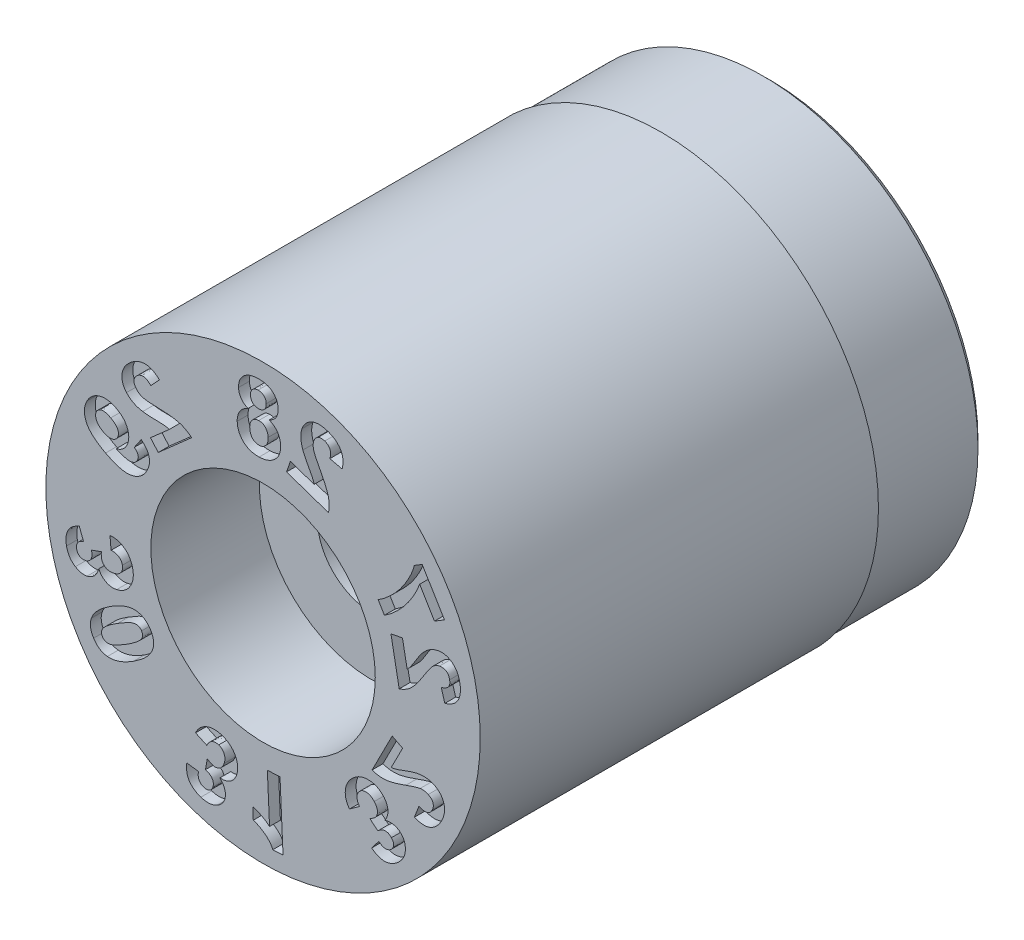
from build123d import *

# Parameters (mm, degrees)
SKETCH4_W          = 3
SKETCH4_H          = 1
CUT_EXTRUDE1_DEPTH = 0.3


with BuildPart() as part:
    # Sketch1 → Revolve1 (revolve)
    with BuildSketch(Plane(origin=(0, 0, 0), x_dir=(0, 0, -1), z_dir=(1, 0, 0)), mode=Mode.PRIVATE) as revolve1_sk:
        Polygon((0, 6), (0, 3.1), (3, 3.1), (3, 1.5), (14, 1.5), (14, 5.75), (13.75, 6), align=None)
    revolve(revolve1_sk.sketch.rotate(Axis((0, 0, 3.797909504), (0, 0, -1)), 90), axis=Axis((0, 0, 3.797909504), (0, 0, -1)))

    # Sketch4 → Cut-Revolve1 (revolve, cut)
    with BuildSketch(Plane(origin=(0, 0, 0), x_dir=(0, 0, -1), z_dir=(1, 0, 0)), mode=Mode.PRIVATE) as cut_revolve1_sk:
        with Locations((12.5, 6.435)):
            Rectangle(SKETCH4_W, SKETCH4_H)
    revolve(cut_revolve1_sk.sketch.rotate(Axis((0, 0, 0), (0, 0, -1)), 90), axis=Axis((0, 0, 0), (0, 0, -1)), mode=Mode.SUBTRACT)

    # Sketch5 → Cut-Extrude1 (cut)
    # profile 1 of 12: a face of its own
    with BuildSketch(Plane.XY):
        with BuildLine():
            Line((3.851545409, 1.325215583), (3.53271147, 1.264786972))
            Line((3.53271147, 1.264786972), (3.761229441, 0.062286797))
            add(Edge.make_bspline(
                [(3.761229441, 0.062286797), (3.790221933, 0.072159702), (3.848185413, 0.091898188), (3.930929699, 0.13313535), (4.009021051, 0.184055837), (4.07128676, 0.233844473), (4.119888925, 0.281100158), (4.159188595, 0.322999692), (4.200101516, 0.371919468), (4.243378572, 0.42716057), (4.289301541, 0.488597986), (4.336818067, 0.557197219), (4.386825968, 0.632065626), (4.420099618, 0.684726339), (4.437296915, 0.711943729)],
                knots=[0, 0, 0, 0, 1.147220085, 2.293589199, 3.454339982, 4.637223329, 5.275329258, 5.994362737, 6.789850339, 7.665130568, 8.624998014, 9.664856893, 10.793094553, 12, 12, 12, 12], degree=3))
            add(Edge.make_bspline(
                [(4.437296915, 0.711943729), (4.451053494, 0.733629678), (4.47726548, 0.774950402), (4.515248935, 0.833582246), (4.550087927, 0.885696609), (4.581806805, 0.931334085), (4.609434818, 0.97113946), (4.634828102, 1.003806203), (4.655883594, 1.030844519), (4.669968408, 1.045694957), (4.676173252, 1.052237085)],
                knots=[0, 0, 0, 0, 1.480685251, 2.821319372, 4.027849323, 5.09469801, 6.026007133, 6.820540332, 7.480407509, 8, 8, 8, 8], degree=3))
            add(Edge.make_bspline(
                [(4.676173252, 1.052237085), (4.691388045, 1.066417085), (4.720771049, 1.093801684), (4.770166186, 1.12535167), (4.819966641, 1.150257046), (4.855123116, 1.158579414), (4.872368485, 1.1626618)],
                knots=[0, 0, 0, 0, 1.090931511, 2.106820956, 3.071335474, 4, 4, 4, 4], degree=3))
            add(Edge.make_bspline(
                [(4.872368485, 1.1626618), (4.890603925, 1.165497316), (4.925280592, 1.170889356), (4.975835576, 1.168345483), (5.021358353, 1.156810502), (5.061405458, 1.135922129), (5.095348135, 1.106642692), (5.122681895, 1.069704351), (5.143190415, 1.02549051), (5.150676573, 0.992830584), (5.154580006, 0.975801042)],
                knots=[0, 0, 0, 0, 1.150072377, 2.186987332, 3.13691429, 4.061498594, 4.981295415, 5.911940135, 6.911243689, 8, 8, 8, 8], degree=3))
            add(Edge.make_bspline(
                [(5.154580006, 0.975801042), (5.157114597, 0.95863357), (5.161981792, 0.925666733), (5.158594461, 0.876845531), (5.145494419, 0.832149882), (5.127251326, 0.798288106), (5.107941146, 0.773726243), (5.090014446, 0.756506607), (5.069241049, 0.740441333), (5.045509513, 0.725560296), (5.018714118, 0.712129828), (4.989284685, 0.69917098), (4.956585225, 0.688099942), (4.933624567, 0.681887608), (4.921704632, 0.6786625)],
                knots=[0, 0, 0, 0, 1.462389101, 2.808237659, 4.094995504, 5.369015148, 6.02924103, 6.726811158, 7.462244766, 8.243668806, 9.088192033, 9.991417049, 10.957252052, 12, 12, 12, 12], degree=3))
            Line((4.921704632, 0.6786625), (5.02070932, 0.343313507))
            add(Edge.make_bspline(
                [(5.02070932, 0.343313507), (5.042968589, 0.350471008), (5.086183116, 0.364366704), (5.146914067, 0.390451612), (5.2022474, 0.419015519), (5.251736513, 0.451127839), (5.29558435, 0.486445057), (5.333330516, 0.525203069), (5.365491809, 0.566903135), (5.39138071, 0.611922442), (5.412378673, 0.659227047), (5.429262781, 0.708219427), (5.441434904, 0.759062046), (5.449951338, 0.811483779), (5.453393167, 0.865872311), (5.452837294, 0.921991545), (5.447388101, 0.979825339), (5.440966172, 1.018658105), (5.437697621, 1.038422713)],
                knots=[0, 0, 0, 0, 1.236899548, 2.40133801, 3.493579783, 4.529124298, 5.518326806, 6.467120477, 7.386052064, 8.298032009, 9.2085038, 10.121896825, 11.03658518, 11.9722747, 12.929255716, 13.917153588, 14.939899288, 16, 16, 16, 16], degree=3))
            add(Edge.make_bspline(
                [(5.437697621, 1.038422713), (5.433205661, 1.059842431), (5.42443768, 1.101652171), (5.406010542, 1.16146012), (5.383839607, 1.216842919), (5.358430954, 1.268173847), (5.328562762, 1.314839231), (5.29477013, 1.356936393), (5.257655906, 1.395141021), (5.216497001, 1.428149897), (5.17286481, 1.456389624), (5.128029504, 1.480219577), (5.081659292, 1.498247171), (5.034188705, 1.511513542), (4.985261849, 1.519914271), (4.935011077, 1.521935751), (4.883528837, 1.52011837), (4.849276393, 1.514406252), (4.831827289, 1.511496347)],
                knots=[0, 0, 0, 0, 1.215675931, 2.372911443, 3.472140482, 4.527892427, 5.550860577, 6.54423819, 7.523199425, 8.504681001, 9.468986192, 10.407992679, 11.321050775, 12.227730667, 13.14336324, 14.072288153, 15.01797241, 16, 16, 16, 16], degree=3))
            add(Edge.make_bspline(
                [(4.831827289, 1.511496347), (4.812054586, 1.507175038), (4.772679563, 1.498569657), (4.715742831, 1.47902357), (4.661025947, 1.454935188), (4.608710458, 1.425053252), (4.557808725, 1.389038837), (4.506925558, 1.347251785), (4.45603253, 1.298451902), (4.42359322, 1.262414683), (4.40678832, 1.243745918)],
                knots=[0, 0, 0, 0, 0.94710676, 1.88605221, 2.813236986, 3.743255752, 4.701947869, 5.729954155, 6.82402269, 8, 8, 8, 8], degree=3))
            add(Edge.make_bspline(
                [(4.40678832, 1.243745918), (4.400810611, 1.236702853), (4.388096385, 1.22172268), (4.36896055, 1.197023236), (4.348125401, 1.168959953), (4.325949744, 1.137137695), (4.301647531, 1.102019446), (4.276354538, 1.062916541), (4.249021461, 1.020650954), (4.22105945, 0.975935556), (4.19361328, 0.931656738), (4.167685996, 0.89045454), (4.144174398, 0.853625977), (4.123490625, 0.820791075), (4.104989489, 0.792433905), (4.088487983, 0.768708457), (4.075031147, 0.748874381), (4.053553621, 0.720697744), (4.02403901, 0.684553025), (3.994798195, 0.65689737), (3.980908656, 0.64376079)],
                knots=[0, 0, 0, 0, 0.676339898, 1.43853413, 2.287243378, 3.235403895, 4.278392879, 5.414137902, 6.645054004, 7.963955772, 9.275627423, 10.459589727, 11.528447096, 12.474941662, 13.301133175, 14.007271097, 14.591130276, 15.055552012, 16.601371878, 18, 18, 18, 18], degree=3))
            Line((3.980908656, 0.64376079), (3.851545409, 1.325215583))
        make_face()
    # profile 2 of 12: a face of its own
    with BuildSketch(Plane.XY):
        with BuildLine():
            Line((4.735695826, 2.169738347), (5.012156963, 2.337046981))
            Line((5.012156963, 2.337046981), (4.396042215, 3.356007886))
            Line((4.396042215, 3.356007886), (4.179944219, 3.225331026))
            add(Edge.make_bspline(
                [(4.179944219, 3.225331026), (4.175545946, 3.208117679), (4.166511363, 3.172759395), (4.14958485, 3.119008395), (4.128794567, 3.063332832), (4.105691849, 3.005130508), (4.078530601, 2.945081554), (4.048544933, 2.88267559), (4.014544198, 2.818485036), (3.966166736, 2.729561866), (3.899218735, 2.619545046), (3.81012806, 2.492151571), (3.712161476, 2.370646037), (3.624369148, 2.274469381), (3.551738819, 2.201086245), (3.497217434, 2.149561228), (3.443497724, 2.100896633), (3.390239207, 2.05541399), (3.33702154, 2.013387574), (3.284134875, 1.974610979), (3.232243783, 1.938219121), (3.1968035, 1.916644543), (3.179394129, 1.906046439)],
                knots=[0, 0, 0, 0, 0.630298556, 1.294709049, 1.998186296, 2.738633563, 3.516077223, 4.336051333, 5.194842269, 6.093036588, 7.927740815, 9.760766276, 11.604872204, 13.461605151, 14.378571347, 15.267760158, 16.122903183, 16.950225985, 17.752262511, 18.528225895, 19.277018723, 20, 20, 20, 20], degree=3))
            Line((3.179394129, 1.906046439), (3.353266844, 1.6190766))
            add(Edge.make_bspline(
                [(3.353266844, 1.6190766), (3.379655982, 1.636298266), (3.432602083, 1.670851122), (3.509189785, 1.727731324), (3.584077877, 1.78814746), (3.657065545, 1.852696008), (3.728066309, 1.921069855), (3.797558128, 1.993191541), (3.865236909, 2.069179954), (3.930495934, 2.149013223), (3.993098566, 2.231267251), (4.052074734, 2.315467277), (4.107617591, 2.400716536), (4.159350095, 2.487301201), (4.206538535, 2.575449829), (4.250259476, 2.664675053), (4.290939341, 2.754907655), (4.314375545, 2.816480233), (4.32607261, 2.847211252)],
                knots=[0, 0, 0, 0, 0.949425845, 1.904889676, 2.873343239, 3.848399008, 4.840106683, 5.84305136, 6.865871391, 7.905712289, 8.949625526, 9.980183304, 11.002922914, 12.015241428, 13.018691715, 14.015012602, 15.009288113, 16, 16, 16, 16], degree=3))
            Line((4.32607261, 2.847211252), (4.735695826, 2.169738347))
        make_face()
    # profile 3 of 12: a face of its own
    with BuildSketch(Plane.XY):
        with BuildLine():
            Line((0.755062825, 4.002481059), (0.650065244, 3.695797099))
            Line((0.650065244, 3.695797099), (1.806849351, 3.299291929))
            add(Edge.make_bspline(
                [(1.806849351, 3.299291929), (1.812700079, 3.329435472), (1.824395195, 3.389689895), (1.828723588, 3.481947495), (1.823648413, 3.574861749), (1.811052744, 3.653337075), (1.794252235, 3.718947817), (1.776988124, 3.773655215), (1.754998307, 3.833458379), (1.728960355, 3.898569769), (1.697886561, 3.968725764), (1.662039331, 4.04394404), (1.621586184, 4.124379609), (1.592488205, 4.179382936), (1.577395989, 4.20791145)],
                knots=[0, 0, 0, 0, 1.150610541, 2.299974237, 3.453286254, 4.637065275, 5.274132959, 5.992668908, 6.788027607, 7.663871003, 8.622817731, 9.665782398, 10.789313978, 12, 12, 12, 12], degree=3))
            add(Edge.make_bspline(
                [(1.577395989, 4.20791145), (1.565376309, 4.230541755), (1.542424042, 4.273755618), (1.510538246, 4.335802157), (1.482310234, 4.39173515), (1.458065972, 4.441726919), (1.43784739, 4.485788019), (1.42128465, 4.523643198), (1.408952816, 4.555495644), (1.402723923, 4.574911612), (1.399964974, 4.583511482)],
                knots=[0, 0, 0, 0, 1.478782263, 2.823819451, 4.025828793, 5.094456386, 6.03003214, 6.823413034, 7.478857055, 8, 8, 8, 8], degree=3))
            add(Edge.make_bspline(
                [(1.399964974, 4.583511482), (1.395490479, 4.603768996), (1.386845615, 4.642907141), (1.382519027, 4.701282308), (1.386658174, 4.756820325), (1.396615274, 4.791513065), (1.401512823, 4.80857721)],
                knots=[0, 0, 0, 0, 1.089945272, 2.105808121, 3.068313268, 4, 4, 4, 4], degree=3))
            add(Edge.make_bspline(
                [(1.401512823, 4.80857721), (1.408122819, 4.825669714), (1.420708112, 4.858213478), (1.447399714, 4.901127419), (1.479970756, 4.934993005), (1.517989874, 4.959343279), (1.560075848, 4.974514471), (1.605696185, 4.980068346), (1.654221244, 4.975877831), (1.686277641, 4.966371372), (1.702982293, 4.961417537)],
                knots=[0, 0, 0, 0, 1.144464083, 2.17903533, 3.137980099, 4.059139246, 4.977987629, 5.912607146, 6.912255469, 8, 8, 8, 8], degree=3))
            add(Edge.make_bspline(
                [(1.702982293, 4.961417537), (1.719196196, 4.955082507), (1.750352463, 4.942909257), (1.791153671, 4.915773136), (1.823375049, 4.882009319), (1.843829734, 4.849412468), (1.855647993, 4.820396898), (1.861718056, 4.7964248), (1.865115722, 4.770440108), (1.866212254, 4.742542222), (1.864896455, 4.712616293), (1.861213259, 4.680724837), (1.854957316, 4.646762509), (1.848986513, 4.623655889), (1.845889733, 4.611671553)],
                knots=[0, 0, 0, 0, 1.466360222, 2.817724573, 4.096595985, 5.379539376, 6.039418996, 6.734305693, 7.460299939, 8.247691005, 9.087940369, 9.986093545, 10.955479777, 12, 12, 12, 12], degree=3))
            Line((1.845889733, 4.611671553), (2.185873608, 4.532154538))
            add(Edge.make_bspline(
                [(2.185873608, 4.532154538), (2.19067236, 4.555071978), (2.199967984, 4.599465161), (2.207882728, 4.665106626), (2.209756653, 4.727330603), (2.206715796, 4.786146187), (2.197125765, 4.841445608), (2.183119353, 4.893473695), (2.162527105, 4.941934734), (2.136548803, 4.986761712), (2.105695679, 5.028245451), (2.071430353, 5.066975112), (2.033481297, 5.102963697), (1.991955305, 5.136146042), (1.946472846, 5.166269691), (1.897098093, 5.192895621), (1.844607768, 5.217729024), (1.807566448, 5.231036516), (1.788683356, 5.23782047)],
                knots=[0, 0, 0, 0, 1.239829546, 2.401663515, 3.496382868, 4.534061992, 5.515097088, 6.463938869, 7.381742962, 8.295361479, 9.201789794, 10.115663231, 11.031295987, 11.968506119, 12.927823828, 13.916406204, 14.937816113, 16, 16, 16, 16], degree=3))
            add(Edge.make_bspline(
                [(1.788683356, 5.23782047), (1.767921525, 5.244546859), (1.727386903, 5.257679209), (1.666314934, 5.271252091), (1.607108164, 5.279376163), (1.549882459, 5.282332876), (1.494581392, 5.279716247), (1.441331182, 5.271330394), (1.389814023, 5.257971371), (1.340952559, 5.238321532), (1.294710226, 5.214956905), (1.252299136, 5.187204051), (1.213159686, 5.156626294), (1.17818358, 5.121752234), (1.147296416, 5.082986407), (1.120213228, 5.04071805), (1.096752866, 4.9949466), (1.084593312, 4.962459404), (1.078401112, 4.94591544)],
                knots=[0, 0, 0, 0, 1.2134108, 2.369017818, 3.474387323, 4.534221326, 5.551972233, 6.547874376, 7.527916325, 8.505405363, 9.471504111, 10.405201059, 11.320151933, 12.229701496, 13.145570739, 14.071809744, 15.01807745, 16, 16, 16, 16], degree=3))
            add(Edge.make_bspline(
                [(1.078401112, 4.94591544), (1.072197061, 4.926560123), (1.059882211, 4.888140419), (1.049091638, 4.828893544), (1.043201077, 4.769473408), (1.043155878, 4.709203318), (1.049029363, 4.647080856), (1.060673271, 4.582286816), (1.077221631, 4.514008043), (1.092521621, 4.468212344), (1.100418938, 4.444574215)],
                knots=[0, 0, 0, 0, 0.951916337, 1.889524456, 2.816296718, 3.748298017, 4.709991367, 5.737457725, 6.8321553, 8, 8, 8, 8], degree=3))
            add(Edge.make_bspline(
                [(1.100418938, 4.444574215), (1.103653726, 4.435952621), (1.110523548, 4.417642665), (1.122378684, 4.388706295), (1.136740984, 4.356759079), (1.153270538, 4.321535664), (1.172107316, 4.283217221), (1.192978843, 4.241594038), (1.216987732, 4.197314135), (1.241679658, 4.150707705), (1.266331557, 4.104884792), (1.289555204, 4.062231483), (1.309823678, 4.023555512), (1.327793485, 3.989155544), (1.34339906, 3.959101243), (1.355593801, 3.932952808), (1.36626483, 3.911431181), (1.380363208, 3.878923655), (1.396849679, 3.835341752), (1.405913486, 3.796314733), (1.410214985, 3.777793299)],
                knots=[0, 0, 0, 0, 0.674642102, 1.432759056, 2.290563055, 3.240651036, 4.283325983, 5.418816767, 6.651777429, 7.973393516, 9.283123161, 10.463984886, 11.531541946, 12.482141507, 13.307645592, 14.012134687, 14.595854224, 15.067130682, 16.60811955, 18, 18, 18, 18], degree=3))
            Line((1.410214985, 3.777793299), (0.755062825, 4.002481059))
        make_face()
    # profile 4 of 12: a face of its own
    with BuildSketch(Plane.XY):
        with BuildLine():
            add(Edge.make_bspline(
                [(0.169265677, 4.697981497), (0.180127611, 4.703097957), (0.201431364, 4.713132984), (0.231558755, 4.730360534), (0.259289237, 4.748770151), (0.284842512, 4.768417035), (0.307894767, 4.789438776), (0.328548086, 4.811767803), (0.347208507, 4.835023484), (0.368138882, 4.867995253), (0.389489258, 4.911338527), (0.407455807, 4.966089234), (0.417540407, 5.023123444), (0.418054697, 5.061831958), (0.418314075, 5.081354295)],
                knots=[0, 0, 0, 0, 0.886536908, 1.738784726, 2.560532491, 3.343378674, 4.117231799, 4.861687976, 5.588173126, 6.31607382, 7.742214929, 9.144305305, 10.559752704, 12, 12, 12, 12], degree=3))
            add(Edge.make_bspline(
                [(0.418314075, 5.081354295), (0.417522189, 5.09806081), (0.415968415, 5.130841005), (0.407572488, 5.178613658), (0.39514586, 5.224053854), (0.378542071, 5.267173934), (0.357069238, 5.307788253), (0.331974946, 5.346471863), (0.301453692, 5.382214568), (0.267298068, 5.415723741), (0.229283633, 5.446373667), (0.186701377, 5.472089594), (0.140872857, 5.494165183), (0.091115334, 5.511149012), (0.038138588, 5.524855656), (-0.018656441, 5.533078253), (-0.078956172, 5.538373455), (-0.120356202, 5.537801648), (-0.141658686, 5.537507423)],
                knots=[0, 0, 0, 0, 0.985063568, 1.932813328, 2.851904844, 3.758846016, 4.650123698, 5.555646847, 6.47107868, 7.414251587, 8.373552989, 9.341861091, 10.340068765, 11.366258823, 12.435993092, 13.560958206, 14.744985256, 16, 16, 16, 16], degree=3))
            add(Edge.make_bspline(
                [(-0.141658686, 5.537507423), (-0.162658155, 5.53658259), (-0.20361547, 5.534778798), (-0.26313466, 5.526533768), (-0.319045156, 5.514809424), (-0.371293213, 5.49919908), (-0.419690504, 5.479144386), (-0.46426233, 5.454920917), (-0.505269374, 5.426701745), (-0.542138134, 5.394449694), (-0.574818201, 5.359118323), (-0.603265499, 5.321636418), (-0.627260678, 5.282055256), (-0.646366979, 5.240217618), (-0.661296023, 5.196316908), (-0.670612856, 5.150111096), (-0.67649936, 5.102020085), (-0.676465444, 5.069280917), (-0.676448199, 5.052634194)],
                knots=[0, 0, 0, 0, 1.240215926, 2.418914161, 3.542131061, 4.609865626, 5.632919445, 6.62885232, 7.599075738, 8.565306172, 9.514178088, 10.435372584, 11.338576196, 12.240468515, 13.145504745, 14.069122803, 15.018216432, 16, 16, 16, 16], degree=3))
            add(Edge.make_bspline(
                [(-0.676448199, 5.052634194), (-0.675237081, 5.03197773), (-0.672868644, 4.991582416), (-0.658397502, 4.933022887), (-0.636375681, 4.878080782), (-0.60556397, 4.827571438), (-0.568100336, 4.781795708), (-0.523527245, 4.742049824), (-0.472533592, 4.708046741), (-0.434699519, 4.691165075), (-0.415338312, 4.682526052)],
                knots=[0, 0, 0, 0, 1.03063853, 2.015493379, 2.994606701, 3.973739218, 4.955937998, 5.935684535, 6.943607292, 8, 8, 8, 8], degree=3))
            add(Edge.make_bspline(
                [(-0.415338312, 4.682526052), (-0.427538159, 4.676989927), (-0.451551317, 4.666093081), (-0.485643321, 4.647139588), (-0.51749523, 4.626601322), (-0.547025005, 4.604289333), (-0.574109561, 4.580358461), (-0.598929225, 4.554735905), (-0.621284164, 4.527383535), (-0.641561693, 4.49852914), (-0.659591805, 4.468401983), (-0.674845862, 4.436904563), (-0.687433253, 4.404300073), (-0.697950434, 4.370870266), (-0.705602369, 4.336210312), (-0.711083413, 4.300545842), (-0.713984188, 4.263737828), (-0.713725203, 4.238908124), (-0.713594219, 4.226350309)],
                knots=[0, 0, 0, 0, 1.105404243, 2.175785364, 3.216006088, 4.231362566, 5.227547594, 6.196255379, 7.172418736, 8.140117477, 9.104836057, 10.067153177, 11.024756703, 11.987340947, 12.956844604, 13.951273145, 14.963840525, 16, 16, 16, 16], degree=3))
            add(Edge.make_bspline(
                [(-0.713594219, 4.226350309), (-0.71261454, 4.205841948), (-0.710691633, 4.165588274), (-0.701450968, 4.106881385), (-0.687400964, 4.051138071), (-0.668310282, 3.998460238), (-0.644170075, 3.948856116), (-0.614734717, 3.90265047), (-0.581024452, 3.858987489), (-0.541830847, 3.819419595), (-0.499270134, 3.783265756), (-0.452726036, 3.75238246), (-0.403325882, 3.726101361), (-0.350381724, 3.705267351), (-0.294343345, 3.689547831), (-0.235207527, 3.678669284), (-0.172847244, 3.673246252), (-0.13030784, 3.67331297), (-0.10850409, 3.673347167)],
                knots=[0, 0, 0, 0, 1.067184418, 2.094662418, 3.084658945, 4.0529084, 5.003539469, 5.947532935, 6.897648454, 7.866635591, 8.838588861, 9.797069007, 10.765803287, 11.743620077, 12.749938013, 13.788325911, 14.86639714, 16, 16, 16, 16], degree=3))
            add(Edge.make_bspline(
                [(-0.10850409, 3.673347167), (-0.088246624, 3.674282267), (-0.04841317, 3.676121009), (0.009946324, 3.68370811), (0.065567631, 3.69560942), (0.11843817, 3.711358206), (0.168522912, 3.731070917), (0.215936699, 3.754814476), (0.260762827, 3.782576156), (0.288281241, 3.80433411), (0.302029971, 3.815204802)],
                knots=[0, 0, 0, 0, 1.098946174, 2.160922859, 3.185808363, 4.179266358, 5.148084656, 6.099578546, 7.050512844, 8, 8, 8, 8], degree=3))
            add(Edge.make_bspline(
                [(0.302029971, 3.815204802), (0.317248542, 3.828709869), (0.347237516, 3.855322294), (0.385815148, 3.90076681), (0.418840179, 3.949218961), (0.44451597, 4.001701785), (0.465460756, 4.056994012), (0.478278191, 4.116212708), (0.486540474, 4.178522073), (0.486370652, 4.221221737), (0.486283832, 4.243051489)],
                knots=[0, 0, 0, 0, 1.009520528, 1.989311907, 2.952310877, 3.914381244, 4.884777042, 5.881470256, 6.916924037, 8, 8, 8, 8], degree=3))
            add(Edge.make_bspline(
                [(0.486283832, 4.243051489), (0.48478112, 4.267257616), (0.481809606, 4.315123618), (0.465740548, 4.384939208), (0.441008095, 4.451407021), (0.412868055, 4.503525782), (0.386029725, 4.542944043), (0.362433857, 4.57031047), (0.336989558, 4.59671309), (0.308452, 4.620678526), (0.277359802, 4.642915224), (0.243687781, 4.663083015), (0.207663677, 4.682001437), (0.18220734, 4.692595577), (0.169265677, 4.697981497)],
                knots=[0, 0, 0, 0, 1.476845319, 2.92036321, 4.349205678, 5.790310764, 6.520151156, 7.252869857, 7.990779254, 8.753929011, 9.521479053, 10.31943313, 11.145622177, 12, 12, 12, 12], degree=3))
        make_face()
        with BuildLine():
            add(Edge.make_bspline(
                [(0.087907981, 5.047936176), (0.087675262, 5.031350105), (0.087232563, 4.999798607), (0.077258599, 4.954936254), (0.059769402, 4.915573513), (0.034439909, 4.882265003), (0.002752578, 4.855464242), (-0.034836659, 4.836528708), (-0.077047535, 4.823728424), (-0.107099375, 4.82189597), (-0.122739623, 4.820942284)],
                knots=[0, 0, 0, 0, 1.134293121, 2.157753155, 3.12550448, 4.063350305, 5.001233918, 5.943264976, 6.929588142, 8, 8, 8, 8], degree=3))
            add(Edge.make_bspline(
                [(-0.122739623, 4.820942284), (-0.138596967, 4.821037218), (-0.169116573, 4.821219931), (-0.212330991, 4.831946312), (-0.251154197, 4.849215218), (-0.284348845, 4.874756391), (-0.312063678, 4.906734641), (-0.331925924, 4.94538214), (-0.344541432, 4.98963853), (-0.346467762, 5.02112886), (-0.347476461, 5.037618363)],
                knots=[0, 0, 0, 0, 1.075213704, 2.06939444, 3.003935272, 3.946660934, 4.894410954, 5.859250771, 6.879024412, 8, 8, 8, 8], degree=3))
            add(Edge.make_bspline(
                [(-0.347476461, 5.037618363), (-0.34734586, 5.053346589), (-0.347095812, 5.083459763), (-0.336788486, 5.126428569), (-0.319269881, 5.164757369), (-0.293466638, 5.197337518), (-0.26221441, 5.224323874), (-0.225116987, 5.244103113), (-0.183174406, 5.256422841), (-0.153415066, 5.258615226), (-0.138041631, 5.259747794)],
                knots=[0, 0, 0, 0, 1.094821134, 2.096138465, 3.05915459, 4.013540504, 4.974071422, 5.921651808, 6.926342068, 8, 8, 8, 8], degree=3))
            add(Edge.make_bspline(
                [(-0.138041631, 5.259747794), (-0.122057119, 5.25950229), (-0.09129985, 5.259029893), (-0.047547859, 5.248406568), (-0.008225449, 5.230996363), (0.02490265, 5.205038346), (0.052188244, 5.173333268), (0.072137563, 5.136010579), (0.084611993, 5.093567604), (0.086779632, 5.063557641), (0.087907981, 5.047936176)],
                knots=[0, 0, 0, 0, 1.096995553, 2.110830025, 3.075127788, 4.034297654, 4.981205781, 5.934245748, 6.924686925, 8, 8, 8, 8], degree=3))
        make_face(mode=Mode.SUBTRACT)
        with BuildLine():
            add(Edge.make_bspline(
                [(0.140927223, 4.267514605), (0.14099936, 4.255814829), (0.141139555, 4.233077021), (0.13841944, 4.199862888), (0.133540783, 4.16847477), (0.126314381, 4.138919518), (0.116885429, 4.111158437), (0.104272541, 4.085775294), (0.090279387, 4.061747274), (0.073158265, 4.040395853), (0.054783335, 4.020890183), (0.034924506, 4.003848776), (0.013837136, 3.98926984), (-0.008638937, 3.977427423), (-0.03207238, 3.967357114), (-0.056978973, 3.960843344), (-0.082847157, 3.955660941), (-0.100624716, 3.95493203), (-0.109724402, 3.954558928)],
                knots=[0, 0, 0, 0, 1.245909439, 2.421349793, 3.545764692, 4.626439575, 5.659456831, 6.661238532, 7.641410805, 8.615358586, 9.569043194, 10.493168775, 11.397809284, 12.29369623, 13.196156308, 14.107588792, 15.031343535, 16, 16, 16, 16], degree=3))
            add(Edge.make_bspline(
                [(-0.109724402, 3.954558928), (-0.118601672, 3.95448479), (-0.135972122, 3.954339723), (-0.161454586, 3.957666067), (-0.185937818, 3.962830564), (-0.209218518, 3.970888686), (-0.231518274, 3.981179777), (-0.25247913, 3.994257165), (-0.272712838, 4.009343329), (-0.291268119, 4.027364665), (-0.30878967, 4.047227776), (-0.323532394, 4.069945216), (-0.336460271, 4.094545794), (-0.347108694, 4.121452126), (-0.35559304, 4.150535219), (-0.36217317, 4.181757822), (-0.366094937, 4.215263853), (-0.367048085, 4.238371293), (-0.367539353, 4.250281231)],
                knots=[0, 0, 0, 0, 0.961822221, 1.882029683, 2.78085562, 3.671742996, 4.548159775, 5.43904715, 6.346818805, 7.280152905, 8.239756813, 9.21341588, 10.209346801, 11.250268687, 12.346047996, 13.491976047, 14.707324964, 16, 16, 16, 16], degree=3))
            add(Edge.make_bspline(
                [(-0.367539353, 4.250281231), (-0.367709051, 4.26075078), (-0.368039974, 4.281167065), (-0.364877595, 4.311021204), (-0.360360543, 4.339351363), (-0.353359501, 4.366285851), (-0.34340912, 4.391465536), (-0.332034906, 4.415649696), (-0.317513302, 4.437723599), (-0.301279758, 4.45833363), (-0.283100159, 4.476822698), (-0.263902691, 4.493647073), (-0.242744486, 4.507161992), (-0.221090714, 4.519424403), (-0.197596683, 4.528215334), (-0.173076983, 4.535256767), (-0.147178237, 4.539617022), (-0.129439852, 4.540465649), (-0.12047503, 4.540894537)],
                knots=[0, 0, 0, 0, 1.172726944, 2.286892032, 3.359505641, 4.387416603, 5.39848839, 6.391098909, 7.377382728, 8.353030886, 9.32770641, 10.280832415, 11.206802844, 12.1370654, 13.064775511, 14.010408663, 14.994478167, 16, 16, 16, 16], degree=3))
            add(Edge.make_bspline(
                [(-0.12047503, 4.540894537), (-0.110117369, 4.540959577), (-0.090013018, 4.541085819), (-0.060770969, 4.537258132), (-0.033409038, 4.531142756), (-0.008008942, 4.522116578), (0.01550283, 4.510480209), (0.036668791, 4.495418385), (0.056386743, 4.478029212), (0.078828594, 4.450807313), (0.102509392, 4.414134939), (0.123791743, 4.367322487), (0.137278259, 4.318132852), (0.139704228, 4.28447993), (0.140927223, 4.267514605)],
                knots=[0, 0, 0, 0, 0.877974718, 1.704160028, 2.496087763, 3.253141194, 3.986344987, 4.714192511, 5.451387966, 6.21037714, 7.700059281, 9.142440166, 10.559428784, 12, 12, 12, 12], degree=3))
        make_face(mode=Mode.SUBTRACT)
    # profile 5 of 12: a face of its own
    with BuildSketch(Plane.XY):
        with BuildLine():
            Line((-3.109843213, 2.633413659), (-2.894509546, 2.389518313))
            Line((-2.894509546, 2.389518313), (-1.974776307, 3.201678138))
            add(Edge.make_bspline(
                [(-1.974776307, 3.201678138), (-1.998191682, 3.221653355), (-2.044998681, 3.261583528), (-2.123064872, 3.311471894), (-2.206605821, 3.353295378), (-2.281529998, 3.381061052), (-2.347121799, 3.398865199), (-2.403409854, 3.41088355), (-2.466403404, 3.421494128), (-2.536222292, 3.430882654), (-2.612833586, 3.438272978), (-2.696147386, 3.44443093), (-2.786192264, 3.449247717), (-2.848527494, 3.451225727), (-2.880825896, 3.452250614)],
                knots=[0, 0, 0, 0, 1.149872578, 2.298578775, 3.453872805, 4.638550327, 5.279229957, 5.994292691, 6.790008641, 7.667626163, 8.628173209, 9.667783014, 10.791584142, 12, 12, 12, 12], degree=3))
            add(Edge.make_bspline(
                [(-2.880825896, 3.452250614), (-2.906597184, 3.453065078), (-2.955660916, 3.454615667), (-3.025645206, 3.45714019), (-3.088381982, 3.460559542), (-3.144035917, 3.463913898), (-3.192448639, 3.467981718), (-3.233615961, 3.4725972), (-3.267454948, 3.477659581), (-3.287421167, 3.482014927), (-3.296215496, 3.483933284)],
                knots=[0, 0, 0, 0, 1.483617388, 2.824531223, 4.02933581, 5.098724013, 6.032566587, 6.824381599, 7.482186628, 8, 8, 8, 8], degree=3))
            add(Edge.make_bspline(
                [(-3.296215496, 3.483933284), (-3.316297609, 3.489908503), (-3.355070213, 3.501444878), (-3.407941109, 3.527442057), (-3.454871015, 3.55798425), (-3.480047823, 3.58409967), (-3.492449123, 3.5969633)],
                knots=[0, 0, 0, 0, 1.092898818, 2.110063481, 3.069077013, 4, 4, 4, 4], degree=3))
            add(Edge.make_bspline(
                [(-3.492449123, 3.5969633), (-3.504180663, 3.611213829), (-3.526483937, 3.638306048), (-3.550065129, 3.683102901), (-3.563683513, 3.728131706), (-3.565911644, 3.773258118), (-3.558058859, 3.817400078), (-3.540715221, 3.85996056), (-3.512591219, 3.899976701), (-3.488478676, 3.923273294), (-3.475843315, 3.935481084)],
                knots=[0, 0, 0, 0, 1.148921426, 2.184258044, 3.135231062, 4.06132771, 4.974490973, 5.91149549, 6.905590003, 8, 8, 8, 8], degree=3))
            add(Edge.make_bspline(
                [(-3.475843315, 3.935481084), (-3.462305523, 3.946446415), (-3.436265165, 3.967538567), (-3.392277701, 3.989287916), (-3.347133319, 4.001391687), (-3.308510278, 4.003066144), (-3.277516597, 3.998685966), (-3.253466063, 3.992334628), (-3.229096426, 3.982462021), (-3.204171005, 3.969530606), (-3.178549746, 3.953800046), (-3.152772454, 3.934309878), (-3.126128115, 3.912214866), (-3.108907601, 3.895680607), (-3.100023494, 3.88715054)],
                knots=[0, 0, 0, 0, 1.46313506, 2.814385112, 4.095562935, 5.374358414, 6.036446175, 6.725458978, 7.463071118, 8.24517902, 9.087552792, 9.990791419, 10.9634442, 12, 12, 12, 12], degree=3))
            Line((-3.100023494, 3.88715054), (-2.861485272, 4.143257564))
            add(Edge.make_bspline(
                [(-2.861485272, 4.143257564), (-2.879174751, 4.158862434), (-2.913372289, 4.189029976), (-2.966780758, 4.228588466), (-3.019978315, 4.261380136), (-3.073119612, 4.28744882), (-3.125915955, 4.307121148), (-3.1784109, 4.320713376), (-3.230854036, 4.326675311), (-3.282823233, 4.32629282), (-3.33426732, 4.320222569), (-3.384964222, 4.309251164), (-3.435165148, 4.294264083), (-3.484596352, 4.274192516), (-3.533207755, 4.249270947), (-3.581352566, 4.220090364), (-3.628693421, 4.186138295), (-3.65890819, 4.160598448), (-3.674310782, 4.147578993)],
                knots=[0, 0, 0, 0, 1.24423091, 2.405363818, 3.502016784, 4.537343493, 5.523266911, 6.470492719, 7.391077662, 8.299715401, 9.206964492, 10.119294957, 11.033581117, 11.968008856, 12.929961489, 13.913067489, 14.936143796, 16, 16, 16, 16], degree=3))
            add(Edge.make_bspline(
                [(-3.674310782, 4.147578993), (-3.690569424, 4.132750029), (-3.722223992, 4.103878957), (-3.763923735, 4.056994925), (-3.800531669, 4.009763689), (-3.831742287, 3.961605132), (-3.856421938, 3.911874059), (-3.875927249, 3.86134838), (-3.889428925, 3.809691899), (-3.896845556, 3.757444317), (-3.899197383, 3.705632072), (-3.896682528, 3.654734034), (-3.888551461, 3.605340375), (-3.875569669, 3.557476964), (-3.857164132, 3.511345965), (-3.83382378, 3.466773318), (-3.805969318, 3.423168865), (-3.783323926, 3.396559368), (-3.771823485, 3.38304576)],
                knots=[0, 0, 0, 0, 1.218879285, 2.373082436, 3.472029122, 4.528904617, 5.547623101, 6.543509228, 7.525823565, 8.499794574, 9.462849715, 10.396544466, 11.318821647, 12.231826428, 13.139942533, 14.065456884, 15.017544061, 16, 16, 16, 16], degree=3))
            add(Edge.make_bspline(
                [(-3.771823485, 3.38304576), (-3.758083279, 3.368128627), (-3.73075628, 3.338460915), (-3.684716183, 3.299638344), (-3.63596558, 3.264937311), (-3.583269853, 3.23534094), (-3.526238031, 3.209700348), (-3.464170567, 3.187045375), (-3.396129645, 3.168477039), (-3.348576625, 3.158835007), (-3.324033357, 3.15385852)],
                knots=[0, 0, 0, 0, 0.947566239, 1.884552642, 2.809911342, 3.742448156, 4.705563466, 5.7313501, 6.829094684, 8, 8, 8, 8], degree=3))
            add(Edge.make_bspline(
                [(-3.324033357, 3.15385852), (-3.314945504, 3.152280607), (-3.295566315, 3.148915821), (-3.264421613, 3.145319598), (-3.229456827, 3.141732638), (-3.190613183, 3.138366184), (-3.147850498, 3.135716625), (-3.101306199, 3.13382641), (-3.050882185, 3.131920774), (-2.998049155, 3.130992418), (-2.945697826, 3.129986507), (-2.896945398, 3.128766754), (-2.85315898, 3.127478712), (-2.814340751, 3.126035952), (-2.780366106, 3.124467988), (-2.751361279, 3.122744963), (-2.727311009, 3.120982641), (-2.692097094, 3.117282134), (-2.645977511, 3.110161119), (-2.607435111, 3.098826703), (-2.5890829, 3.093429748)],
                knots=[0, 0, 0, 0, 0.673662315, 1.436536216, 2.289348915, 3.241374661, 4.284367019, 5.418771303, 6.644111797, 7.970285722, 9.27860367, 10.469033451, 11.532673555, 12.478502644, 13.306588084, 14.017030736, 14.601025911, 15.067811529, 16.603819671, 18, 18, 18, 18], degree=3))
            Line((-2.5890829, 3.093429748), (-3.109843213, 2.633413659))
        make_face()
    # profile 6 of 12: a face of its own
    with BuildSketch(Plane.XY):
        with BuildLine():
            Line((-3.365823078, 2.459908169), (-3.557253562, 2.179041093))
            add(Edge.make_bspline(
                [(-3.557253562, 2.179041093), (-3.544150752, 2.169347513), (-3.519390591, 2.151029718), (-3.488479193, 2.119547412), (-3.465751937, 2.086518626), (-3.451889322, 2.051649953), (-3.445922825, 2.015751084), (-3.447662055, 1.979142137), (-3.456464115, 1.941647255), (-3.468072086, 1.918125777), (-3.474123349, 1.905863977)],
                knots=[0, 0, 0, 0, 1.226595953, 2.317877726, 3.30839066, 4.227134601, 5.121969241, 6.029215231, 6.972625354, 8, 8, 8, 8], degree=3))
            add(Edge.make_bspline(
                [(-3.474123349, 1.905863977), (-3.478530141, 1.898245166), (-3.487277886, 1.883121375), (-3.503222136, 1.862516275), (-3.521958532, 1.844720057), (-3.542708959, 1.829064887), (-3.565549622, 1.81525541), (-3.591032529, 1.804774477), (-3.618450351, 1.796195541), (-3.64853236, 1.789881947), (-3.682621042, 1.786961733), (-3.721261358, 1.789531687), (-3.765003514, 1.796080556), (-3.813666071, 1.807367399), (-3.867253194, 1.823950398), (-3.926141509, 1.844166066), (-3.990038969, 1.869306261), (-4.033836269, 1.888584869), (-4.05670167, 1.898649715)],
                knots=[0, 0, 0, 0, 0.655584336, 1.301373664, 1.933712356, 2.575790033, 3.236153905, 3.916841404, 4.623817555, 5.37546625, 6.203558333, 7.165106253, 8.254206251, 9.498090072, 10.88403758, 12.433513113, 14.138032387, 16, 16, 16, 16], degree=3))
            add(Edge.make_bspline(
                [(-4.05670167, 1.898649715), (-4.040765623, 1.902728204), (-4.009568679, 1.910712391), (-3.965172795, 1.928283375), (-3.923689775, 1.94907867), (-3.885751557, 1.974716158), (-3.851062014, 2.004238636), (-3.819723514, 2.037832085), (-3.791555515, 2.075515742), (-3.775851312, 2.103037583), (-3.767837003, 2.117082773)],
                knots=[0, 0, 0, 0, 1.053815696, 2.062985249, 3.054816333, 4.023826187, 4.991265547, 5.969708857, 6.963883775, 8, 8, 8, 8], degree=3))
            add(Edge.make_bspline(
                [(-3.767837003, 2.117082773), (-3.760046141, 2.132916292), (-3.744689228, 2.164126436), (-3.727303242, 2.21298126), (-3.715824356, 2.262643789), (-3.709250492, 2.313105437), (-3.708504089, 2.364391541), (-3.713828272, 2.416338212), (-3.723678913, 2.469160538), (-3.739080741, 2.522138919), (-3.759864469, 2.57419091), (-3.785658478, 2.624094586), (-3.816887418, 2.670965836), (-3.85282405, 2.715253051), (-3.894019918, 2.756600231), (-3.940471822, 2.794792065), (-3.991481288, 2.830688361), (-4.028453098, 2.851270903), (-4.047332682, 2.861781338)],
                knots=[0, 0, 0, 0, 0.953814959, 1.8801066, 2.796911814, 3.705784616, 4.627393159, 5.563924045, 6.525415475, 7.529892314, 8.542533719, 9.552227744, 10.56224968, 11.583141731, 12.632189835, 13.712894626, 14.832094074, 16, 16, 16, 16], degree=3))
            add(Edge.make_bspline(
                [(-4.047332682, 2.861781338), (-4.06736986, 2.871969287), (-4.106683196, 2.891958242), (-4.167313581, 2.914956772), (-4.227154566, 2.932780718), (-4.28663039, 2.943401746), (-4.345400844, 2.948843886), (-4.403766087, 2.94762537), (-4.461554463, 2.940409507), (-4.518260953, 2.926985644), (-4.573161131, 2.908542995), (-4.624950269, 2.884294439), (-4.673611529, 2.85528925), (-4.718797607, 2.821316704), (-4.760784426, 2.782486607), (-4.798824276, 2.738326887), (-4.833952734, 2.6895375), (-4.853913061, 2.654080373), (-4.864082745, 2.636015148)],
                knots=[0, 0, 0, 0, 1.132655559, 2.222292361, 3.264547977, 4.276538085, 5.263395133, 6.236013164, 7.214002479, 8.194304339, 9.169601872, 10.129030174, 11.071976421, 12.021109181, 12.974417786, 13.94971532, 14.955390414, 16, 16, 16, 16], degree=3))
            add(Edge.make_bspline(
                [(-4.864082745, 2.636015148), (-4.874279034, 2.615826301), (-4.89429199, 2.576200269), (-4.914984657, 2.513823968), (-4.929988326, 2.451587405), (-4.936025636, 2.388634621), (-4.935864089, 2.325345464), (-4.927754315, 2.261710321), (-4.911846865, 2.19779619), (-4.88928381, 2.133275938), (-4.857706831, 2.068661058), (-4.81515942, 2.005532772), (-4.76268406, 1.943244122), (-4.700258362, 1.881800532), (-4.627503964, 1.821189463), (-4.544526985, 1.761710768), (-4.451575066, 1.702572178), (-4.384770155, 1.666220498), (-4.350156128, 1.647385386)],
                knots=[0, 0, 0, 0, 0.8610786, 1.690097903, 2.498621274, 3.296795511, 4.094392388, 4.907096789, 5.735414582, 6.601028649, 7.508497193, 8.468656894, 9.495359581, 10.608630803, 11.803338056, 13.101444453, 14.498154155, 16, 16, 16, 16], degree=3))
            add(Edge.make_bspline(
                [(-4.350156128, 1.647385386), (-4.31446597, 1.629066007), (-4.245597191, 1.593716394), (-4.142893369, 1.548720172), (-4.045133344, 1.512724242), (-3.952285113, 1.485925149), (-3.864261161, 1.46845481), (-3.781185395, 1.459651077), (-3.702730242, 1.460570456), (-3.629239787, 1.471129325), (-3.560666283, 1.489282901), (-3.496331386, 1.51326393), (-3.436935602, 1.544504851), (-3.381527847, 1.581526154), (-3.330729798, 1.625049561), (-3.284461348, 1.675032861), (-3.242963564, 1.731497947), (-3.219431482, 1.772702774), (-3.207431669, 1.793714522)],
                knots=[0, 0, 0, 0, 1.475868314, 2.847878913, 4.122874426, 5.306609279, 6.399878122, 7.420939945, 8.375183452, 9.278994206, 10.145409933, 10.981013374, 11.799766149, 12.608990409, 13.428254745, 14.255055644, 15.110193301, 16, 16, 16, 16], degree=3))
            add(Edge.make_bspline(
                [(-3.207431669, 1.793714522), (-3.199623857, 1.809208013), (-3.184329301, 1.839557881), (-3.165731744, 1.885900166), (-3.151133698, 1.931608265), (-3.141696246, 1.97686614), (-3.135561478, 2.021388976), (-3.134363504, 2.065512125), (-3.137977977, 2.108982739), (-3.145168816, 2.15186425), (-3.156863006, 2.193969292), (-3.173496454, 2.234954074), (-3.194138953, 2.275180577), (-3.219640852, 2.31426892), (-3.24976501, 2.352240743), (-3.284206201, 2.389318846), (-3.322776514, 2.42583102), (-3.351219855, 2.448347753), (-3.365823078, 2.459908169)],
                knots=[0, 0, 0, 0, 1.098812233, 2.15243963, 3.16026953, 4.134686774, 5.077883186, 6.00451935, 6.924691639, 7.837591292, 8.755785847, 9.687118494, 10.635312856, 11.616268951, 12.638990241, 13.702520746, 14.820440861, 16, 16, 16, 16], degree=3))
        make_face()
        with BuildLine():
            add(Edge.make_bspline(
                [(-4.409031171, 2.121116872), (-4.420957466, 2.127827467), (-4.444162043, 2.140884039), (-4.476704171, 2.162112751), (-4.506060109, 2.184345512), (-4.532145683, 2.207814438), (-4.554973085, 2.232462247), (-4.574566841, 2.258126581), (-4.590696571, 2.284925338), (-4.603780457, 2.312254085), (-4.613849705, 2.339694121), (-4.620718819, 2.366764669), (-4.625385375, 2.393050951), (-4.626470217, 2.418809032), (-4.624520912, 2.443767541), (-4.619604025, 2.467985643), (-4.612664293, 2.491798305), (-4.605202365, 2.506591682), (-4.601446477, 2.514037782)],
                knots=[0, 0, 0, 0, 1.348930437, 2.624567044, 3.827384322, 4.976102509, 6.079407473, 7.135000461, 8.153667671, 9.157535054, 10.11823225, 11.030032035, 11.908222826, 12.745441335, 13.564588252, 14.369733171, 15.17942132, 16, 16, 16, 16], degree=3))
            add(Edge.make_bspline(
                [(-4.601446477, 2.514037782), (-4.593392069, 2.527397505), (-4.577589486, 2.55360901), (-4.543816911, 2.584993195), (-4.503846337, 2.608046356), (-4.466022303, 2.620037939), (-4.433001, 2.624868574), (-4.405818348, 2.624898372), (-4.376888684, 2.622259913), (-4.346388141, 2.615557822), (-4.31405616, 2.606825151), (-4.280296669, 2.593902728), (-4.24450196, 2.578556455), (-4.220543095, 2.566174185), (-4.208124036, 2.559755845)],
                knots=[0, 0, 0, 0, 1.252138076, 2.456669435, 3.667208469, 4.945650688, 5.627611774, 6.349855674, 7.130795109, 7.963966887, 8.862850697, 9.827390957, 10.873829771, 12, 12, 12, 12], degree=3))
            add(Edge.make_bspline(
                [(-4.208124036, 2.559755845), (-4.195662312, 2.552983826), (-4.171444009, 2.539822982), (-4.138104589, 2.517990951), (-4.107739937, 2.496378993), (-4.082030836, 2.473150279), (-4.058544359, 2.450529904), (-4.039544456, 2.42661023), (-4.023880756, 2.402266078), (-4.012164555, 2.377396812), (-4.00345457, 2.352367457), (-3.997340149, 2.327546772), (-3.994149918, 2.302868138), (-3.993807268, 2.278465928), (-3.996505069, 2.254477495), (-4.00154714, 2.230674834), (-4.010042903, 2.207356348), (-4.017302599, 2.192259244), (-4.020983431, 2.184604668)],
                knots=[0, 0, 0, 0, 1.4409183, 2.800302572, 4.048627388, 5.223916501, 6.318687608, 7.358891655, 8.320810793, 9.255095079, 10.145621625, 11.010922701, 11.848659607, 12.669565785, 13.485039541, 14.297639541, 15.136864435, 16, 16, 16, 16], degree=3))
            add(Edge.make_bspline(
                [(-4.020983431, 2.184604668), (-4.029389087, 2.170681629), (-4.045875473, 2.143373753), (-4.081202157, 2.110483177), (-4.123134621, 2.086130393), (-4.162841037, 2.073227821), (-4.197122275, 2.067799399), (-4.224462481, 2.066203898), (-4.252824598, 2.067905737), (-4.282173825, 2.072349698), (-4.312644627, 2.079879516), (-4.343835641, 2.091271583), (-4.376590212, 2.104201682), (-4.39799652, 2.115363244), (-4.409031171, 2.121116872)],
                knots=[0, 0, 0, 0, 1.321040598, 2.59101565, 3.886000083, 5.249889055, 5.967168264, 6.712923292, 7.478407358, 8.279770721, 9.131006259, 10.032751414, 10.985910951, 12, 12, 12, 12], degree=3))
        make_face(mode=Mode.SUBTRACT)
    # profile 7 of 12: a face of its own
    with BuildSketch(Plane.XY):
        with BuildLine():
            Line((-4.227784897, -0.262828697), (-4.19893733, -0.603363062))
            add(Edge.make_bspline(
                [(-4.19893733, -0.603363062), (-4.178172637, -0.602428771), (-4.13856943, -0.600646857), (-4.081606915, -0.607238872), (-4.030873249, -0.622958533), (-3.986619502, -0.646760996), (-3.949232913, -0.677356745), (-3.919380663, -0.714068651), (-3.896428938, -0.755968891), (-3.88860641, -0.786975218), (-3.884626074, -0.802752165)],
                knots=[0, 0, 0, 0, 1.213737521, 2.314886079, 3.333042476, 4.299932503, 5.234598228, 6.13726069, 7.052182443, 8, 8, 8, 8], degree=3))
            add(Edge.make_bspline(
                [(-3.884626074, -0.802752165), (-3.883021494, -0.811493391), (-3.87987867, -0.828614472), (-3.878446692, -0.854556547), (-3.87974711, -0.879941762), (-3.883789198, -0.904841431), (-3.890941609, -0.928994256), (-3.900041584, -0.952932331), (-3.912790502, -0.976039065), (-3.927610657, -0.998571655), (-3.945048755, -1.019820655), (-3.964455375, -1.039814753), (-3.98672202, -1.057333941), (-4.010817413, -1.073312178), (-4.03749642, -1.086612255), (-4.066024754, -1.098896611), (-4.097112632, -1.108719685), (-4.118783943, -1.113648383), (-4.129855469, -1.116166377)],
                knots=[0, 0, 0, 0, 0.955723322, 1.871936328, 2.788530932, 3.68711262, 4.579347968, 5.495656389, 6.437372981, 7.413013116, 8.394727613, 9.391641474, 10.405252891, 11.437834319, 12.497739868, 13.608552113, 14.778247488, 16, 16, 16, 16], degree=3))
            add(Edge.make_bspline(
                [(-4.129855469, -1.116166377), (-4.140437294, -1.11810734), (-4.161033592, -1.121885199), (-4.191571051, -1.125319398), (-4.220994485, -1.125504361), (-4.249102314, -1.123455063), (-4.276126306, -1.119021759), (-4.301709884, -1.111492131), (-4.326628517, -1.102475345), (-4.35668866, -1.085764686), (-4.390775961, -1.061679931), (-4.423472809, -1.025183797), (-4.448170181, -0.983048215), (-4.456569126, -0.951652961), (-4.460831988, -0.935718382)],
                knots=[0, 0, 0, 0, 0.91796547, 1.786713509, 2.618223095, 3.424905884, 4.189689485, 4.949498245, 5.698304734, 6.444979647, 7.878119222, 9.237452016, 10.597876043, 12, 12, 12, 12], degree=3))
            add(Edge.make_bspline(
                [(-4.460831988, -0.935718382), (-4.46291252, -0.924094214), (-4.467288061, -0.89964757), (-4.469778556, -0.860695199), (-4.470211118, -0.817968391), (-4.468787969, -0.788295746), (-4.468042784, -0.772758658)],
                knots=[0, 0, 0, 0, 0.86582241, 1.82090034, 2.858987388, 4, 4, 4, 4], degree=3))
            Line((-4.468042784, -0.772758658), (-4.739630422, -0.869233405))
            add(Edge.make_bspline(
                [(-4.739630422, -0.869233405), (-4.737265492, -0.880437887), (-4.732658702, -0.902263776), (-4.728312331, -0.9344723), (-4.725901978, -0.965129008), (-4.727086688, -0.994156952), (-4.730363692, -1.021509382), (-4.73618199, -1.047273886), (-4.744455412, -1.071552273), (-4.755584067, -1.094059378), (-4.768872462, -1.114652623), (-4.783392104, -1.133848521), (-4.800406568, -1.15034268), (-4.818980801, -1.164931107), (-4.839120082, -1.178015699), (-4.861530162, -1.188180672), (-4.885337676, -1.197332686), (-4.902166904, -1.201077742), (-4.910815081, -1.203002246)],
                knots=[0, 0, 0, 0, 1.289332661, 2.51156915, 3.658389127, 4.747747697, 5.777742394, 6.75752327, 7.717261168, 8.659886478, 9.577183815, 10.47506972, 11.364276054, 12.236961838, 13.133353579, 14.060927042, 15.003552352, 16, 16, 16, 16], degree=3))
            add(Edge.make_bspline(
                [(-4.910815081, -1.203002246), (-4.92522494, -1.20542723), (-4.9530469, -1.210109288), (-4.994366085, -1.20820582), (-5.032644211, -1.198210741), (-5.066981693, -1.180413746), (-5.096892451, -1.156109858), (-5.120790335, -1.125207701), (-5.139341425, -1.088719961), (-5.146134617, -1.061577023), (-5.149662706, -1.047480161)],
                knots=[0, 0, 0, 0, 1.088781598, 2.102174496, 3.062126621, 4.020674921, 4.968450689, 5.91635965, 6.917847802, 8, 8, 8, 8], degree=3))
            add(Edge.make_bspline(
                [(-5.149662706, -1.047480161), (-5.152059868, -1.033118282), (-5.156747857, -1.005031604), (-5.152298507, -0.962711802), (-5.14128952, -0.921907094), (-5.121065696, -0.883354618), (-5.092763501, -0.847608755), (-5.055115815, -0.817082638), (-5.00974392, -0.7906927), (-4.975501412, -0.778258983), (-4.957560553, -0.771744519)],
                knots=[0, 0, 0, 0, 0.936923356, 1.832285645, 2.723873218, 3.655127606, 4.624719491, 5.649899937, 6.768699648, 8, 8, 8, 8], degree=3))
            Line((-4.957560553, -0.771744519), (-5.077059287, -0.466773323))
            add(Edge.make_bspline(
                [(-5.077059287, -0.466773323), (-5.101671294, -0.478000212), (-5.148781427, -0.499489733), (-5.213667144, -0.536407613), (-5.269192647, -0.576226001), (-5.31666335, -0.61858282), (-5.355656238, -0.665669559), (-5.387619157, -0.71788006), (-5.412887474, -0.775566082), (-5.431319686, -0.838150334), (-5.442968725, -0.904353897), (-5.44603047, -0.973368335), (-5.44302693, -1.044550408), (-5.434211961, -1.092050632), (-5.429715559, -1.116279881)],
                knots=[0, 0, 0, 0, 1.194954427, 2.287276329, 3.292452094, 4.209206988, 5.090524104, 5.983584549, 6.905692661, 7.864943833, 8.86021905, 9.867781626, 10.912383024, 12, 12, 12, 12], degree=3))
            add(Edge.make_bspline(
                [(-5.429715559, -1.116279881), (-5.424910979, -1.136781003), (-5.4155202, -1.176851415), (-5.395797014, -1.234103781), (-5.37144973, -1.287042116), (-5.343036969, -1.336018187), (-5.309787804, -1.38055535), (-5.272230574, -1.420828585), (-5.230731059, -1.457530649), (-5.199736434, -1.477824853), (-5.184116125, -1.488052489)],
                knots=[0, 0, 0, 0, 1.101330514, 2.152602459, 3.162156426, 4.146208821, 5.109974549, 6.063586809, 7.02410908, 8, 8, 8, 8], degree=3))
            add(Edge.make_bspline(
                [(-5.184116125, -1.488052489), (-5.17105807, -1.495828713), (-5.145357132, -1.511133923), (-5.105046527, -1.529109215), (-5.064791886, -1.543791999), (-5.02424465, -1.553790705), (-4.983402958, -1.559531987), (-4.94240669, -1.561471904), (-4.901017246, -1.558740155), (-4.873716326, -1.554004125), (-4.859939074, -1.551614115)],
                knots=[0, 0, 0, 0, 1.075688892, 2.117177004, 3.120739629, 4.107712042, 5.068986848, 6.038148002, 7.009962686, 8, 8, 8, 8], degree=3))
            add(Edge.make_bspline(
                [(-4.859939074, -1.551614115), (-4.84087682, -1.546915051), (-4.803291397, -1.537649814), (-4.750698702, -1.513596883), (-4.703093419, -1.481989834), (-4.659491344, -1.443724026), (-4.621645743, -1.397103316), (-4.588341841, -1.343396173), (-4.559686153, -1.282285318), (-4.545025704, -1.238174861), (-4.537426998, -1.215311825)],
                knots=[0, 0, 0, 0, 0.957641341, 1.888200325, 2.808008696, 3.742027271, 4.71120834, 5.730252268, 6.823559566, 8, 8, 8, 8], degree=3))
            add(Edge.make_bspline(
                [(-4.537426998, -1.215311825), (-4.531759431, -1.227192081), (-4.520605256, -1.250573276), (-4.50134661, -1.283936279), (-4.479336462, -1.31444408), (-4.455816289, -1.343095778), (-4.429562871, -1.3687181), (-4.401284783, -1.391796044), (-4.37107861, -1.412783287), (-4.33877313, -1.431026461), (-4.304695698, -1.446120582), (-4.269902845, -1.458977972), (-4.234023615, -1.467789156), (-4.197398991, -1.473625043), (-4.159886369, -1.476784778), (-4.121339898, -1.475756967), (-4.081897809, -1.472560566), (-4.055630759, -1.467451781), (-4.042340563, -1.464866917)],
                knots=[0, 0, 0, 0, 1.047485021, 2.061525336, 3.060746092, 4.038636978, 5.008328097, 5.974858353, 6.940943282, 7.93252657, 8.922517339, 9.904798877, 10.880830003, 11.857350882, 12.854799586, 13.871806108, 14.923209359, 16, 16, 16, 16], degree=3))
            add(Edge.make_bspline(
                [(-4.042340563, -1.464866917), (-4.023032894, -1.460411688), (-3.985118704, -1.451663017), (-3.931026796, -1.431212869), (-3.87998703, -1.406785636), (-3.832274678, -1.377040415), (-3.788112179, -1.342244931), (-3.746830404, -1.302854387), (-3.70937199, -1.258143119), (-3.675497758, -1.209196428), (-3.645663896, -1.157303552), (-3.622033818, -1.102778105), (-3.603336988, -1.047088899), (-3.590684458, -0.989708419), (-3.584340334, -0.930680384), (-3.58336719, -0.870236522), (-3.588017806, -0.808184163), (-3.59556085, -0.7668637), (-3.599410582, -0.745775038)],
                knots=[0, 0, 0, 0, 1.009438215, 1.982219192, 2.941570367, 3.891442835, 4.842740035, 5.804134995, 6.796057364, 7.81154412, 8.836573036, 9.843051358, 10.83687154, 11.828180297, 12.833019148, 13.859196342, 14.90740124, 16, 16, 16, 16], degree=3))
            add(Edge.make_bspline(
                [(-3.599410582, -0.745775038), (-3.603874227, -0.726062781), (-3.612644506, -0.687331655), (-3.63156306, -0.631759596), (-3.653738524, -0.579564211), (-3.679942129, -0.53085337), (-3.709513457, -0.485490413), (-3.743642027, -0.444054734), (-3.781226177, -0.405822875), (-3.822654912, -0.371628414), (-3.866838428, -0.341398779), (-3.912966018, -0.315636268), (-3.961085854, -0.294876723), (-4.010886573, -0.278637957), (-4.062629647, -0.267416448), (-4.116144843, -0.260994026), (-4.171470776, -0.258576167), (-4.20881344, -0.261396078), (-4.227784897, -0.262828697)],
                knots=[0, 0, 0, 0, 1.10875818, 2.178515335, 3.217142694, 4.218558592, 5.210894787, 6.184537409, 7.160210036, 8.149493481, 9.128168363, 10.09531926, 11.044910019, 12.00039795, 12.966301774, 13.945975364, 14.956479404, 16, 16, 16, 16], degree=3))
        make_face()
    # profile 8 of 12: a face of its own
    with BuildSketch(Plane.XY):
        with BuildLine():
            add(Edge.make_bspline(
                [(-4.679743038, -2.945563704), (-4.667794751, -2.963406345), (-4.644544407, -2.998126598), (-4.604400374, -3.044741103), (-4.561567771, -3.085585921), (-4.515281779, -3.119945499), (-4.46592468, -3.14817834), (-4.413419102, -3.169653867), (-4.358053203, -3.185811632), (-4.319689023, -3.190972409), (-4.300245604, -3.193587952)],
                knots=[0, 0, 0, 0, 1.095163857, 2.131095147, 3.132574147, 4.110290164, 5.065958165, 6.026714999, 6.999915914, 8, 8, 8, 8], degree=3))
            add(Edge.make_bspline(
                [(-4.300245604, -3.193587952), (-4.275823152, -3.195309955), (-4.225313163, -3.198871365), (-4.146774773, -3.190631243), (-4.063534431, -3.174740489), (-3.975898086, -3.147934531), (-3.883185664, -3.11260215), (-3.785883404, -3.067216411), (-3.683661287, -3.012531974), (-3.615510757, -2.970438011), (-3.580191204, -2.94862248)],
                knots=[0, 0, 0, 0, 0.758152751, 1.567995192, 2.440010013, 3.38447062, 4.406124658, 5.515768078, 6.712527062, 8, 8, 8, 8], degree=3))
            add(Edge.make_bspline(
                [(-3.580191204, -2.94862248), (-3.545453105, -2.926111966), (-3.478373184, -2.882643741), (-3.385590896, -2.813513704), (-3.302471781, -2.745452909), (-3.230921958, -2.676489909), (-3.168919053, -2.608559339), (-3.118729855, -2.539830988), (-3.077586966, -2.471771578), (-3.058710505, -2.424334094), (-3.049558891, -2.401335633)],
                knots=[0, 0, 0, 0, 1.280938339, 2.473515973, 3.579527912, 4.60372095, 5.547170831, 6.422066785, 7.234992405, 8, 8, 8, 8], degree=3))
            add(Edge.make_bspline(
                [(-3.049558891, -2.401335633), (-3.043736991, -2.382775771), (-3.032287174, -2.346274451), (-3.023054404, -2.28996658), (-3.02024083, -2.233843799), (-3.025018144, -2.177587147), (-3.036159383, -2.121327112), (-3.055119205, -2.065363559), (-3.079584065, -2.008991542), (-3.101178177, -1.973198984), (-3.11222853, -1.954882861)],
                knots=[0, 0, 0, 0, 0.997470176, 1.961705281, 2.919898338, 3.875097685, 4.852689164, 5.856381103, 6.903046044, 8, 8, 8, 8], degree=3))
            add(Edge.make_bspline(
                [(-3.11222853, -1.954882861), (-3.124271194, -1.936975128), (-3.147900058, -1.901838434), (-3.189069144, -1.854791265), (-3.234036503, -1.813975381), (-3.282313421, -1.778851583), (-3.334749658, -1.750112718), (-3.390956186, -1.728128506), (-3.450597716, -1.711519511), (-3.51416278, -1.701373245), (-3.582695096, -1.698734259), (-3.656533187, -1.706960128), (-3.735929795, -1.724191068), (-3.820764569, -1.751383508), (-3.911209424, -1.787843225), (-4.007430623, -1.833848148), (-4.109442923, -1.889309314), (-4.177952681, -1.931769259), (-4.213556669, -1.953835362)],
                knots=[0, 0, 0, 0, 0.829810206, 1.628167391, 2.398466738, 3.162604, 3.920263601, 4.692663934, 5.480068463, 6.298377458, 7.164409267, 8.110662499, 9.148993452, 10.286365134, 11.534360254, 12.898914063, 14.388389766, 16, 16, 16, 16], degree=3))
            add(Edge.make_bspline(
                [(-4.213556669, -1.953835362), (-4.248089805, -1.976342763), (-4.314723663, -2.019772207), (-4.40753987, -2.087955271), (-4.489749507, -2.156135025), (-4.561561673, -2.2242283), (-4.622592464, -2.292531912), (-4.673432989, -2.360589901), (-4.714297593, -2.428590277), (-4.733141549, -2.475900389), (-4.742253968, -2.498778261)],
                knots=[0, 0, 0, 0, 1.280840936, 2.471463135, 3.576846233, 4.598006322, 5.544171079, 6.419551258, 7.235738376, 8, 8, 8, 8], degree=3))
            add(Edge.make_bspline(
                [(-4.742253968, -2.498778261), (-4.748062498, -2.517340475), (-4.759521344, -2.553959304), (-4.768941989, -2.61035634), (-4.771722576, -2.666604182), (-4.766955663, -2.722859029), (-4.755811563, -2.77911956), (-4.736852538, -2.835082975), (-4.712387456, -2.89145503), (-4.690793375, -2.927247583), (-4.679743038, -2.945563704)],
                knots=[0, 0, 0, 0, 0.996714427, 1.966280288, 2.923747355, 3.87822298, 4.855073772, 5.858005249, 6.903877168, 8, 8, 8, 8], degree=3))
        make_face()
        with BuildLine():
            add(Edge.make_bspline(
                [(-4.435462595, -2.791343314), (-4.440572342, -2.782410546), (-4.450653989, -2.76478599), (-4.460022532, -2.735786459), (-4.463642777, -2.705606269), (-4.463090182, -2.673990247), (-4.454980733, -2.640300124), (-4.437388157, -2.605747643), (-4.413345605, -2.568534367), (-4.392304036, -2.545144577), (-4.381063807, -2.532649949)],
                knots=[0, 0, 0, 0, 0.856605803, 1.690102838, 2.520002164, 3.382471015, 4.314954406, 5.38058537, 6.600730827, 8, 8, 8, 8], degree=3))
            add(Edge.make_bspline(
                [(-4.381063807, -2.532649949), (-4.372291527, -2.523725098), (-4.353474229, -2.50458052), (-4.321632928, -2.475637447), (-4.283870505, -2.445074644), (-4.240738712, -2.41226284), (-4.192502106, -2.376867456), (-4.138601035, -2.33953704), (-4.078980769, -2.300406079), (-4.037299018, -2.273671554), (-4.015659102, -2.259791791)],
                knots=[0, 0, 0, 0, 0.657082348, 1.409498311, 2.258041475, 3.207372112, 4.25524711, 5.399620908, 6.649961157, 8, 8, 8, 8], degree=3))
            add(Edge.make_bspline(
                [(-4.015659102, -2.259791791), (-3.994003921, -2.246076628), (-3.952512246, -2.219798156), (-3.891746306, -2.184022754), (-3.836449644, -2.151305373), (-3.785532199, -2.123424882), (-3.739378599, -2.099427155), (-3.698008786, -2.079787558), (-3.661416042, -2.06406925), (-3.620281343, -2.049494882), (-3.575010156, -2.037585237), (-3.52664029, -2.029377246), (-3.48529144, -2.027915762), (-3.45056635, -2.034591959), (-3.421390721, -2.046842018), (-3.396332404, -2.063597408), (-3.373773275, -2.083882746), (-3.36233324, -2.100594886), (-3.356508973, -2.109103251)],
                knots=[0, 0, 0, 0, 1.656455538, 3.173795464, 4.556862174, 5.808506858, 6.92492707, 7.918254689, 8.767566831, 9.497467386, 10.736811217, 11.787390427, 12.664493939, 13.394394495, 14.054201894, 14.695400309, 15.335811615, 16, 16, 16, 16], degree=3))
            add(Edge.make_bspline(
                [(-3.356508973, -2.109103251), (-3.351405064, -2.118036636), (-3.341334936, -2.135662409), (-3.331849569, -2.164752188), (-3.328572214, -2.195075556), (-3.328989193, -2.226799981), (-3.337245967, -2.26030018), (-3.354082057, -2.295106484), (-3.378785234, -2.331795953), (-3.399726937, -2.355265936), (-3.410907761, -2.367796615)],
                knots=[0, 0, 0, 0, 0.856622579, 1.690135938, 2.528672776, 3.391158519, 4.323660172, 5.379115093, 6.600703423, 8, 8, 8, 8], degree=3))
            add(Edge.make_bspline(
                [(-3.410907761, -2.367796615), (-3.419536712, -2.376808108), (-3.437999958, -2.396089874), (-3.47000988, -2.424546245), (-3.507237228, -2.455389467), (-3.549955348, -2.488403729), (-3.598286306, -2.523393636), (-3.65204242, -2.560622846), (-3.711334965, -2.600136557), (-3.753003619, -2.626776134), (-3.774664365, -2.640624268)],
                knots=[0, 0, 0, 0, 0.656823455, 1.405395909, 2.253622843, 3.202730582, 4.247899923, 5.395535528, 6.646113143, 8, 8, 8, 8], degree=3))
            add(Edge.make_bspline(
                [(-3.774664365, -2.640624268), (-3.796325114, -2.654329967), (-3.83782746, -2.680590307), (-3.89858037, -2.716524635), (-3.95417782, -2.748867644), (-4.005255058, -2.776787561), (-4.051192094, -2.80122325), (-4.092925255, -2.820510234), (-4.129561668, -2.836321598), (-4.170792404, -2.850851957), (-4.215872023, -2.863124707), (-4.264352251, -2.871151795), (-4.305943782, -2.872893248), (-4.341044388, -2.866204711), (-4.370028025, -2.853115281), (-4.395784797, -2.837153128), (-4.417801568, -2.816121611), (-4.429522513, -2.799677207), (-4.435462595, -2.791343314)],
                knots=[0, 0, 0, 0, 1.653001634, 3.167177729, 4.551834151, 5.800869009, 6.921283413, 7.906408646, 8.765136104, 9.493514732, 10.724243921, 11.772632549, 12.658530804, 13.394583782, 14.052681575, 14.699375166, 15.340853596, 16, 16, 16, 16], degree=3))
        make_face(mode=Mode.SUBTRACT)
    # profile 9 of 12: a face of its own
    with BuildSketch(Plane.XY):
        with BuildLine():
            Line((-1.863618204, -3.80323821), (-1.554059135, -3.946568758))
            add(Edge.make_bspline(
                [(-1.554059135, -3.946568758), (-1.544770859, -3.928044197), (-1.527036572, -3.892674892), (-1.492292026, -3.847287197), (-1.454175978, -3.810228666), (-1.411121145, -3.784162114), (-1.366228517, -3.766064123), (-1.31947429, -3.758854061), (-1.271775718, -3.759569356), (-1.240995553, -3.768093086), (-1.225279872, -3.772445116)],
                knots=[0, 0, 0, 0, 1.209505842, 2.309333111, 3.326850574, 4.299718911, 5.234501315, 6.138961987, 7.049794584, 8, 8, 8, 8], degree=3))
            add(Edge.make_bspline(
                [(-1.225279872, -3.772445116), (-1.20887177, -3.778666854), (-1.176770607, -3.790839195), (-1.135448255, -3.821804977), (-1.100888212, -3.860213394), (-1.079678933, -3.899019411), (-1.066453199, -3.932701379), (-1.059058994, -3.959469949), (-1.0548647, -3.987298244), (-1.053441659, -4.016117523), (-1.054216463, -4.046022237), (-1.058465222, -4.076795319), (-1.064663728, -4.108700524), (-1.071179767, -4.129861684), (-1.074521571, -4.140714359)],
                knots=[0, 0, 0, 0, 1.411809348, 2.762094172, 4.125419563, 5.560118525, 6.306393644, 7.047566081, 7.798778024, 8.575599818, 9.376906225, 10.212064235, 11.083042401, 12, 12, 12, 12], degree=3))
            add(Edge.make_bspline(
                [(-1.074521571, -4.140714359), (-1.077952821, -4.150894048), (-1.084626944, -4.170694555), (-1.097650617, -4.198495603), (-1.111302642, -4.224420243), (-1.127294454, -4.247761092), (-1.144637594, -4.268888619), (-1.163570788, -4.287695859), (-1.184098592, -4.304111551), (-1.212850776, -4.322704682), (-1.25102339, -4.339566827), (-1.298583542, -4.350752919), (-1.347429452, -4.350859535), (-1.378751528, -4.342508), (-1.394704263, -4.338254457)],
                knots=[0, 0, 0, 0, 0.917504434, 1.784637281, 2.620948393, 3.419407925, 4.198358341, 4.954604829, 5.696122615, 6.441127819, 7.876734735, 9.238205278, 10.593382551, 12, 12, 12, 12], degree=3))
            add(Edge.make_bspline(
                [(-1.394704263, -4.338254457), (-1.405855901, -4.334275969), (-1.429136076, -4.325970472), (-1.46420784, -4.308938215), (-1.50166912, -4.288583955), (-1.526684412, -4.272468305), (-1.539729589, -4.264064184)],
                knots=[0, 0, 0, 0, 0.869261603, 1.814671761, 2.860377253, 4, 4, 4, 4], degree=3))
            Line((-1.539729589, -4.264064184), (-1.590400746, -4.547589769))
            add(Edge.make_bspline(
                [(-1.590400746, -4.547589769), (-1.579470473, -4.551045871), (-1.558282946, -4.557745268), (-1.528053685, -4.569618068), (-1.500852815, -4.583616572), (-1.475508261, -4.59792292), (-1.453722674, -4.614991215), (-1.433789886, -4.632453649), (-1.417106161, -4.651973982), (-1.398382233, -4.679047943), (-1.381157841, -4.715662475), (-1.371283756, -4.762830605), (-1.372402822, -4.81231213), (-1.381018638, -4.844586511), (-1.385474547, -4.861278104)],
                knots=[0, 0, 0, 0, 0.969476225, 1.879257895, 2.741952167, 3.555698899, 4.335292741, 5.077714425, 5.793480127, 6.500137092, 7.858604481, 9.182454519, 10.542828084, 12, 12, 12, 12], degree=3))
            add(Edge.make_bspline(
                [(-1.385474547, -4.861278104), (-1.390614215, -4.875008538), (-1.400464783, -4.901323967), (-1.422497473, -4.936142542), (-1.450010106, -4.964123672), (-1.482098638, -4.985463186), (-1.518065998, -4.999074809), (-1.556586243, -5.004607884), (-1.597387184, -5.002846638), (-1.624261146, -4.995387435), (-1.638260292, -4.991501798)],
                knots=[0, 0, 0, 0, 1.096292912, 2.10112942, 3.06058926, 4.016200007, 4.965896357, 5.916261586, 6.914541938, 8, 8, 8, 8], degree=3))
            add(Edge.make_bspline(
                [(-1.638260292, -4.991501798), (-1.651859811, -4.986394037), (-1.678497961, -4.976389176), (-1.713600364, -4.952337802), (-1.742761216, -4.921843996), (-1.766664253, -4.885635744), (-1.783416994, -4.843193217), (-1.791654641, -4.79554439), (-1.791717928, -4.743150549), (-1.785874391, -4.707352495), (-1.78279786, -4.688505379)],
                knots=[0, 0, 0, 0, 0.937445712, 1.836228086, 2.725179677, 3.653953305, 4.626614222, 5.655619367, 6.765720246, 8, 8, 8, 8], degree=3))
            Line((-1.78279786, -4.688505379), (-2.106951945, -4.641331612))
            add(Edge.make_bspline(
                [(-2.106951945, -4.641331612), (-2.109397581, -4.668136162), (-2.114090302, -4.719569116), (-2.114140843, -4.793971), (-2.106768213, -4.861914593), (-2.093362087, -4.924099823), (-2.071736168, -4.981482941), (-2.042196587, -5.035059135), (-2.004236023, -5.085281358), (-1.959455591, -5.132481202), (-1.907445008, -5.175076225), (-1.849506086, -5.212378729), (-1.786058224, -5.244578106), (-1.740650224, -5.260486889), (-1.717452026, -5.268614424)],
                knots=[0, 0, 0, 0, 1.190539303, 2.284423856, 3.285272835, 4.209365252, 5.091359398, 5.988583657, 6.906644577, 7.869373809, 8.860878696, 9.873162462, 10.913433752, 12, 12, 12, 12], degree=3))
            add(Edge.make_bspline(
                [(-1.717452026, -5.268614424), (-1.697344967, -5.274546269), (-1.657984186, -5.286158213), (-1.598515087, -5.29726783), (-1.540527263, -5.302926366), (-1.483926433, -5.301565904), (-1.428787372, -5.295646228), (-1.375230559, -5.282544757), (-1.323020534, -5.264163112), (-1.289956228, -5.247460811), (-1.273303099, -5.239048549)],
                knots=[0, 0, 0, 0, 1.097301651, 2.148034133, 3.163314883, 4.142663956, 5.108325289, 6.061710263, 7.023763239, 8, 8, 8, 8], degree=3))
            add(Edge.make_bspline(
                [(-1.273303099, -5.239048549), (-1.260169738, -5.231513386), (-1.234324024, -5.216684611), (-1.198683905, -5.190855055), (-1.16624339, -5.163019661), (-1.137222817, -5.132962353), (-1.112010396, -5.100258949), (-1.090251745, -5.065449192), (-1.071570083, -5.028414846), (-1.062477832, -5.002218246), (-1.057880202, -4.98897155)],
                knots=[0, 0, 0, 0, 1.072758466, 2.111128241, 3.11457355, 4.099977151, 5.067394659, 6.036105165, 7.006927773, 8, 8, 8, 8], degree=3))
            add(Edge.make_bspline(
                [(-1.057880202, -4.98897155), (-1.052532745, -4.970098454), (-1.042010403, -4.932961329), (-1.037233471, -4.875548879), (-1.040057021, -4.818556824), (-1.052868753, -4.762024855), (-1.074278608, -4.706092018), (-1.10405547, -4.650426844), (-1.142971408, -4.595381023), (-1.173943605, -4.5607968), (-1.189976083, -4.542894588)],
                knots=[0, 0, 0, 0, 0.958201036, 1.885479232, 2.805001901, 3.741961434, 4.709403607, 5.728765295, 6.824315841, 8, 8, 8, 8], degree=3))
            add(Edge.make_bspline(
                [(-1.189976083, -4.542894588), (-1.176817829, -4.543968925), (-1.150964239, -4.546079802), (-1.112461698, -4.545061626), (-1.0750416, -4.541832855), (-1.038699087, -4.534934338), (-1.003464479, -4.525355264), (-0.969373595, -4.512100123), (-0.936218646, -4.496259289), (-0.904363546, -4.477193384), (-0.874304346, -4.455515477), (-0.846448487, -4.431135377), (-0.820383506, -4.404822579), (-0.797400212, -4.375417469), (-0.776148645, -4.344231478), (-0.75760282, -4.310515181), (-0.74117417, -4.274606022), (-0.732514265, -4.249343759), (-0.728122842, -4.236533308)],
                knots=[0, 0, 0, 0, 1.050476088, 2.063995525, 3.062531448, 4.038136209, 5.005267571, 5.965795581, 6.946439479, 7.927863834, 8.917832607, 9.893093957, 10.872663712, 11.861955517, 12.860251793, 13.874715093, 14.922271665, 16, 16, 16, 16], degree=3))
            add(Edge.make_bspline(
                [(-0.728122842, -4.236533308), (-0.722543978, -4.217649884), (-0.711526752, -4.180358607), (-0.702460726, -4.123441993), (-0.698329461, -4.066960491), (-0.700752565, -4.010994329), (-0.709153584, -3.955377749), (-0.723152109, -3.900303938), (-0.743466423, -3.845750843), (-0.769040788, -3.792189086), (-0.799690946, -3.74081686), (-0.835028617, -3.69306629), (-0.874643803, -3.649743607), (-0.917879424, -3.610101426), (-0.966044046, -3.575540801), (-1.017878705, -3.544417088), (-1.074347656, -3.5181929), (-1.113993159, -3.504200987), (-1.134180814, -3.497076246)],
                knots=[0, 0, 0, 0, 1.004476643, 1.983656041, 2.935937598, 3.892240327, 4.83721983, 5.80353283, 6.788383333, 7.804779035, 8.830368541, 9.838248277, 10.832445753, 11.82384839, 12.82763911, 13.853995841, 14.907245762, 16, 16, 16, 16], degree=3))
            add(Edge.make_bspline(
                [(-1.134180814, -3.497076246), (-1.153579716, -3.491241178), (-1.191575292, -3.479812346), (-1.249056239, -3.468313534), (-1.305331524, -3.461880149), (-1.360444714, -3.460516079), (-1.414400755, -3.464237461), (-1.467217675, -3.47326956), (-1.519022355, -3.486970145), (-1.569259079, -3.505816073), (-1.617170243, -3.529245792), (-1.662424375, -3.556535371), (-1.704467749, -3.587697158), (-1.743012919, -3.623148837), (-1.778502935, -3.662226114), (-1.810278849, -3.705641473), (-1.83924694, -3.752594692), (-1.855414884, -3.786191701), (-1.863618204, -3.80323821)],
                knots=[0, 0, 0, 0, 1.113473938, 2.180900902, 3.218401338, 4.224723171, 5.208288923, 6.187668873, 7.166932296, 8.15070687, 9.133158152, 10.095707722, 11.052954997, 12.005685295, 12.97114699, 13.950899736, 14.960323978, 16, 16, 16, 16], degree=3))
        make_face()
    # profile 10 of 12: a face of its own
    with BuildSketch(Plane.XY):
        with BuildLine():
            Line((0.468578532, -3.689375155), (0.119162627, -3.705381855))
            Line((0.119162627, -3.705381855), (0.179182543, -5.022724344))
            add(Edge.make_bspline(
                [(0.179182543, -5.022724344), (0.162429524, -5.008752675), (0.12894823, -4.980829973), (0.07569028, -4.9429288), (0.020529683, -4.907919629), (-0.036436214, -4.875669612), (-0.095440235, -4.846567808), (-0.156489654, -4.820787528), (-0.219343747, -4.797284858), (-0.262552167, -4.784614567), (-0.284343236, -4.778224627)],
                knots=[0, 0, 0, 0, 0.990866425, 1.980269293, 2.967338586, 3.958393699, 4.953152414, 5.954717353, 6.96851364, 8, 8, 8, 8], degree=3))
            Line((-0.284343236, -4.778224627), (-0.269785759, -5.095572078))
            add(Edge.make_bspline(
                [(-0.269785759, -5.095572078), (-0.245919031, -5.103167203), (-0.196021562, -5.119046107), (-0.121382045, -5.153894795), (-0.043230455, -5.198130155), (0.022725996, -5.2420065), (0.075577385, -5.280851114), (0.112328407, -5.312765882), (0.146462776, -5.345586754), (0.176930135, -5.380379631), (0.204793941, -5.416278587), (0.2294673, -5.453836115), (0.250790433, -5.49294064), (0.262798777, -5.5199894), (0.268776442, -5.533454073)],
                knots=[0, 0, 0, 0, 1.259585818, 2.633379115, 4.136071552, 5.776978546, 6.617708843, 7.43554198, 8.225036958, 8.999344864, 9.761079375, 10.510820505, 11.258697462, 12, 12, 12, 12], degree=3))
            Line((0.268776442, -5.533454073), (0.552220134, -5.520513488))
            Line((0.552220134, -5.520513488), (0.468578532, -3.689375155))
        make_face()
    # profile 11 of 12: a face of its own
    with BuildSketch(Plane.XY):
        with BuildLine():
            Line((2.387126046, -3.500626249), (2.665212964, -3.300825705))
            add(Edge.make_bspline(
                [(2.665212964, -3.300825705), (2.653759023, -3.283534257), (2.631846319, -3.25045373), (2.608520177, -3.198111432), (2.595585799, -3.146394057), (2.593636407, -3.095970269), (2.601214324, -3.048079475), (2.616808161, -3.003380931), (2.641998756, -2.962632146), (2.664442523, -2.939805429), (2.675959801, -2.928091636)],
                knots=[0, 0, 0, 0, 1.208194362, 2.311414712, 3.324363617, 4.299418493, 5.233232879, 6.137062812, 7.044012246, 8, 8, 8, 8], degree=3))
            add(Edge.make_bspline(
                [(2.675959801, -2.928091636), (2.682625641, -2.922242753), (2.695729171, -2.910745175), (2.71719359, -2.896173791), (2.739714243, -2.884379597), (2.763287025, -2.875370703), (2.787556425, -2.868306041), (2.813049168, -2.864806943), (2.839410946, -2.86326216), (2.866546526, -2.864664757), (2.893946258, -2.868194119), (2.920840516, -2.875740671), (2.9475775, -2.885157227), (2.973387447, -2.898441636), (2.998924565, -2.914041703), (3.024072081, -2.932497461), (3.048344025, -2.954303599), (3.06369976, -2.970359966), (3.071530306, -2.978547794)],
                knots=[0, 0, 0, 0, 0.951616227, 1.87066183, 2.778367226, 3.675268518, 4.577105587, 5.485960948, 6.431981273, 7.409139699, 8.400096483, 9.391404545, 10.402791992, 11.439172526, 12.501269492, 13.614580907, 14.783572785, 16, 16, 16, 16], degree=3))
            add(Edge.make_bspline(
                [(3.071530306, -2.978547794), (3.07862011, -2.986553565), (3.092526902, -3.002257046), (3.110427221, -3.027224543), (3.126599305, -3.051929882), (3.138944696, -3.077380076), (3.148859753, -3.102956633), (3.155811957, -3.128751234), (3.160418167, -3.154753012), (3.162155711, -3.189165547), (3.15856276, -3.230963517), (3.143768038, -3.277851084), (3.120158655, -3.320761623), (3.097224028, -3.343886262), (3.085564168, -3.355642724)],
                knots=[0, 0, 0, 0, 0.910097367, 1.785174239, 2.613919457, 3.421453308, 4.188946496, 4.947038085, 5.69319277, 6.433084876, 7.877107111, 9.237905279, 10.59576353, 12, 12, 12, 12], degree=3))
            add(Edge.make_bspline(
                [(3.085564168, -3.355642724), (3.07664475, -3.363402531), (3.057856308, -3.379748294), (3.0257446, -3.402189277), (2.989210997, -3.424732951), (2.962819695, -3.438665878), (2.949014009, -3.445954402)],
                knots=[0, 0, 0, 0, 0.863640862, 1.819229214, 2.859206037, 4, 4, 4, 4], degree=3))
            Line((2.949014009, -3.445954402), (3.171353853, -3.630168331))
            add(Edge.make_bspline(
                [(3.171353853, -3.630168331), (3.179799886, -3.622262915), (3.196118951, -3.606988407), (3.221892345, -3.586897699), (3.247180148, -3.569393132), (3.272631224, -3.555236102), (3.297808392, -3.543904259), (3.323009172, -3.53548267), (3.348375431, -3.530839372), (3.38126709, -3.527632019), (3.421648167, -3.530759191), (3.467617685, -3.545510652), (3.510434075, -3.570631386), (3.534360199, -3.594204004), (3.546703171, -3.60636461)],
                knots=[0, 0, 0, 0, 0.974762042, 1.883393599, 2.75206689, 3.565048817, 4.334647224, 5.077216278, 5.798533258, 6.503528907, 7.860402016, 9.177069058, 10.543710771, 12, 12, 12, 12], degree=3))
            add(Edge.make_bspline(
                [(3.546703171, -3.60636461), (3.556079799, -3.617703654), (3.574067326, -3.639455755), (3.593958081, -3.675793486), (3.604482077, -3.713816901), (3.607358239, -3.752492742), (3.601221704, -3.790688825), (3.58750454, -3.827494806), (3.565201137, -3.8619509), (3.545521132, -3.881818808), (3.535333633, -3.892103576)],
                knots=[0, 0, 0, 0, 1.095129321, 2.100826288, 3.059971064, 4.014384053, 4.968797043, 5.91964574, 6.923089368, 8, 8, 8, 8], degree=3))
            add(Edge.make_bspline(
                [(3.535333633, -3.892103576), (3.524201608, -3.901514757), (3.502424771, -3.919925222), (3.463730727, -3.938154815), (3.422697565, -3.949105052), (3.379100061, -3.950940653), (3.333846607, -3.945016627), (3.288130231, -3.928628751), (3.242404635, -3.902728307), (3.214119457, -3.879869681), (3.199280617, -3.867877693)],
                knots=[0, 0, 0, 0, 0.936524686, 1.83206064, 2.731793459, 3.659663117, 4.627541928, 5.657643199, 6.771163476, 8, 8, 8, 8], degree=3))
            Line((3.199280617, -3.867877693), (2.998179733, -4.127234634))
            add(Edge.make_bspline(
                [(2.998179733, -4.127234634), (3.020407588, -4.142785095), (3.062834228, -4.172466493), (3.128132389, -4.208745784), (3.190726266, -4.236276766), (3.251648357, -4.255254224), (3.312135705, -4.264395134), (3.373350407, -4.265910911), (3.435864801, -4.257268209), (3.499275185, -4.24145168), (3.562208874, -4.217277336), (3.62349351, -4.185143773), (3.682768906, -4.14545818), (3.719169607, -4.113705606), (3.737712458, -4.097530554)],
                knots=[0, 0, 0, 0, 1.196531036, 2.283836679, 3.290321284, 4.21018046, 5.090585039, 5.981809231, 6.90280231, 7.866474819, 8.860733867, 9.870018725, 10.914967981, 12, 12, 12, 12], degree=3))
            add(Edge.make_bspline(
                [(3.737712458, -4.097530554), (3.752983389, -4.082954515), (3.782811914, -4.054483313), (3.821642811, -4.007827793), (3.854928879, -3.959883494), (3.882336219, -3.910194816), (3.903918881, -3.858859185), (3.919710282, -3.805918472), (3.929428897, -3.751235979), (3.93107284, -3.714186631), (3.931901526, -3.69551064)],
                knots=[0, 0, 0, 0, 1.101534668, 2.151614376, 3.162982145, 4.145262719, 5.108952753, 6.065161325, 7.024678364, 8, 8, 8, 8], degree=3))
            add(Edge.make_bspline(
                [(3.931901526, -3.69551064), (3.931897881, -3.680304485), (3.931890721, -3.650438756), (3.926966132, -3.606433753), (3.918502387, -3.56433211), (3.906307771, -3.524158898), (3.890739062, -3.485890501), (3.871121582, -3.449643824), (3.847813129, -3.41525189), (3.829634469, -3.394214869), (3.820482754, -3.383624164)],
                knots=[0, 0, 0, 0, 1.073773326, 2.108950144, 3.122607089, 4.104385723, 5.071195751, 6.036757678, 7.011641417, 8, 8, 8, 8], degree=3))
            add(Edge.make_bspline(
                [(3.820482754, -3.383624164), (3.806610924, -3.369749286), (3.779250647, -3.342382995), (3.731931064, -3.309227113), (3.680396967, -3.284094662), (3.624778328, -3.267323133), (3.565378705, -3.257563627), (3.501961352, -3.256741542), (3.434604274, -3.263020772), (3.389139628, -3.273205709), (3.365634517, -3.278471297)],
                knots=[0, 0, 0, 0, 0.955597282, 1.884784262, 2.802967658, 3.740964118, 4.708494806, 5.729415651, 6.826113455, 8, 8, 8, 8], degree=3))
            add(Edge.make_bspline(
                [(3.365634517, -3.278471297), (3.373087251, -3.267636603), (3.387842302, -3.24618589), (3.405936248, -3.212114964), (3.421943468, -3.177968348), (3.433578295, -3.142797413), (3.442933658, -3.107296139), (3.447993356, -3.070906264), (3.450577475, -3.034012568), (3.449766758, -2.996774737), (3.44540665, -2.959698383), (3.438439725, -2.923193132), (3.427568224, -2.887694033), (3.413863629, -2.853100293), (3.39711512, -2.819259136), (3.376862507, -2.786371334), (3.353348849, -2.754314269), (3.335614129, -2.734109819), (3.326612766, -2.723854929)],
                knots=[0, 0, 0, 0, 1.042545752, 2.064050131, 3.056869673, 4.030991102, 4.998995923, 5.965871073, 6.940918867, 7.931342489, 8.915943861, 9.900159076, 10.875888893, 11.856815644, 12.849922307, 13.867698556, 14.917737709, 16, 16, 16, 16], degree=3))
            add(Edge.make_bspline(
                [(3.326612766, -2.723854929), (3.312928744, -2.709645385), (3.285925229, -2.681604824), (3.240927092, -2.645187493), (3.193673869, -2.613820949), (3.143504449, -2.588431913), (3.091126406, -2.567648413), (3.035844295, -2.553244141), (2.978279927, -2.543185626), (2.918762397, -2.539421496), (2.858807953, -2.54067926), (2.799701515, -2.54788006), (2.742170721, -2.560658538), (2.686298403, -2.579313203), (2.631998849, -2.603545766), (2.57985828, -2.634318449), (2.528496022, -2.669674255), (2.496900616, -2.697597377), (2.480807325, -2.711820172)],
                knots=[0, 0, 0, 0, 1.003459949, 1.98018882, 2.940130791, 3.885597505, 4.837579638, 5.803190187, 6.788552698, 7.808255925, 8.833984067, 9.837444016, 10.834450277, 11.829040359, 12.831447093, 13.855247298, 14.907558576, 16, 16, 16, 16], degree=3))
            add(Edge.make_bspline(
                [(2.480807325, -2.711820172), (2.466121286, -2.725866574), (2.437306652, -2.753426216), (2.399208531, -2.798201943), (2.365196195, -2.84383162), (2.336646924, -2.891293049), (2.313446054, -2.940419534), (2.29500878, -2.990832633), (2.280981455, -3.042711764), (2.273034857, -3.095966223), (2.269259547, -3.149395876), (2.271133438, -3.202440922), (2.277715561, -3.254541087), (2.289171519, -3.305804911), (2.306247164, -3.355949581), (2.327982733, -3.405421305), (2.354817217, -3.454105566), (2.376251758, -3.484968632), (2.387126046, -3.500626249)],
                knots=[0, 0, 0, 0, 1.112109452, 2.182006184, 3.214682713, 4.22565449, 5.209143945, 6.185102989, 7.161757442, 8.146304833, 9.128758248, 10.090915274, 11.047599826, 12.000800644, 12.961945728, 13.943454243, 14.956662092, 16, 16, 16, 16], degree=3))
        make_face()
    # profile 12 of 12: a face of its own
    with BuildSketch(Plane.XY):
        with BuildLine():
            Line((3.855828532, -1.3107949), (3.567202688, -1.163766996))
            Line((3.567202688, -1.163766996), (3.0123696, -2.253083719))
            add(Edge.make_bspline(
                [(3.0123696, -2.253083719), (3.041406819, -2.263027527), (3.099342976, -2.282867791), (3.189887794, -2.300952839), (3.282684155, -2.308375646), (3.362284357, -2.307103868), (3.429648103, -2.299757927), (3.486150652, -2.290392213), (3.548430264, -2.277052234), (3.616354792, -2.259719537), (3.690100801, -2.238990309), (3.769452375, -2.214068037), (3.854528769, -2.185386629), (3.913015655, -2.164360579), (3.943271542, -2.15348358)],
                knots=[0, 0, 0, 0, 1.151426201, 2.297369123, 3.455162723, 4.641406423, 5.279940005, 5.997851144, 6.790801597, 7.670525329, 8.62939982, 9.666565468, 10.792889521, 12, 12, 12, 12], degree=3))
            add(Edge.make_bspline(
                [(3.943271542, -2.15348358), (3.967410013, -2.144651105), (4.013375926, -2.127831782), (4.079384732, -2.105093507), (4.13873329, -2.08517194), (4.191545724, -2.068013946), (4.238036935, -2.054293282), (4.277891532, -2.043443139), (4.31115304, -2.035291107), (4.331334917, -2.032208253), (4.340300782, -2.030838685)],
                knots=[0, 0, 0, 0, 1.482678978, 2.823405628, 4.027107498, 5.093935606, 6.026453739, 6.822795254, 7.477022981, 8, 8, 8, 8], degree=3))
            add(Edge.make_bspline(
                [(4.340300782, -2.030838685), (4.360976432, -2.029055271), (4.401052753, -2.025598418), (4.459547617, -2.029962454), (4.514051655, -2.041591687), (4.54695731, -2.056268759), (4.563124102, -2.063479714)],
                knots=[0, 0, 0, 0, 1.089036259, 2.110916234, 3.07187915, 4, 4, 4, 4], degree=3))
            add(Edge.make_bspline(
                [(4.563124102, -2.063479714), (4.579196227, -2.072481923), (4.609721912, -2.089579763), (4.648271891, -2.122302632), (4.676800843, -2.159366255), (4.695838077, -2.20008728), (4.704910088, -2.243816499), (4.703881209, -2.289748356), (4.693026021, -2.337271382), (4.679083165, -2.367744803), (4.671818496, -2.383622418)],
                knots=[0, 0, 0, 0, 1.150696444, 2.185510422, 3.138982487, 4.055579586, 4.974237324, 5.907445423, 6.909713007, 8, 8, 8, 8], degree=3))
            add(Edge.make_bspline(
                [(4.671818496, -2.383622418), (4.663356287, -2.398756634), (4.647088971, -2.427849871), (4.614329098, -2.464163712), (4.576750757, -2.49179384), (4.541323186, -2.506879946), (4.511073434, -2.51454133), (4.486476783, -2.517072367), (4.460308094, -2.517137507), (4.432513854, -2.514634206), (4.403097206, -2.508659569), (4.37205584, -2.500154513), (4.339069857, -2.489659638), (4.317114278, -2.480354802), (4.305776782, -2.475549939)],
                knots=[0, 0, 0, 0, 1.46105701, 2.808660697, 4.095667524, 5.372295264, 6.03338691, 6.725991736, 7.454748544, 8.241713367, 9.07888826, 9.986628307, 10.960328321, 12, 12, 12, 12], degree=3))
            Line((4.305776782, -2.475549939), (4.178976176, -2.801418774))
            add(Edge.make_bspline(
                [(4.178976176, -2.801418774), (4.200951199, -2.80944801), (4.243595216, -2.825029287), (4.307741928, -2.841200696), (4.368899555, -2.852273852), (4.427557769, -2.857248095), (4.483574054, -2.85575845), (4.537147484, -2.848853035), (4.588002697, -2.835298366), (4.636047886, -2.815801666), (4.681432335, -2.791180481), (4.724838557, -2.76302387), (4.765716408, -2.730489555), (4.804157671, -2.693806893), (4.840057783, -2.652932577), (4.873917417, -2.608270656), (4.905176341, -2.55940534), (4.923798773, -2.524764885), (4.933300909, -2.507089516)],
                knots=[0, 0, 0, 0, 1.239014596, 2.404391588, 3.500222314, 4.529821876, 5.517652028, 6.464377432, 7.385688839, 8.29837941, 9.205316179, 10.117937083, 11.036760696, 11.969503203, 12.92989763, 13.916439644, 14.936858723, 16, 16, 16, 16], degree=3))
            add(Edge.make_bspline(
                [(4.933300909, -2.507089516), (4.9429444, -2.48742765), (4.961731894, -2.449122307), (4.983418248, -2.390496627), (5.000295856, -2.333383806), (5.010659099, -2.27704927), (5.01595375, -2.221911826), (5.015112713, -2.167865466), (5.009110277, -2.115025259), (4.996681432, -2.063888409), (4.979720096, -2.014987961), (4.958837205, -1.968865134), (4.933311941, -1.926279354), (4.903730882, -1.886858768), (4.870102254, -1.850440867), (4.83192538, -1.81780934), (4.789905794, -1.788143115), (4.759454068, -1.771517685), (4.743949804, -1.763052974)],
                knots=[0, 0, 0, 0, 1.217749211, 2.372424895, 3.473229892, 4.527410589, 5.554421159, 6.55017301, 7.529551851, 8.507115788, 9.47161335, 10.406062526, 11.318958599, 12.228264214, 13.144022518, 14.07093974, 15.017833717, 16, 16, 16, 16], degree=3))
            add(Edge.make_bspline(
                [(4.743949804, -1.763052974), (4.725730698, -1.754309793), (4.689520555, -1.736932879), (4.632628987, -1.717706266), (4.574697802, -1.703316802), (4.514895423, -1.694680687), (4.452563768, -1.691910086), (4.386721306, -1.694642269), (4.316804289, -1.701442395), (4.269201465, -1.710306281), (4.244666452, -1.714874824)],
                knots=[0, 0, 0, 0, 0.946768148, 1.881684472, 2.809599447, 3.742508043, 4.709667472, 5.730642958, 6.830348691, 8, 8, 8, 8], degree=3))
            add(Edge.make_bspline(
                [(4.244666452, -1.714874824), (4.235720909, -1.716719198), (4.216561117, -1.720669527), (4.186416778, -1.728840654), (4.152721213, -1.738118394), (4.115728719, -1.74965175), (4.075241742, -1.762610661), (4.031340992, -1.777770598), (3.983937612, -1.794382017), (3.93454758, -1.812644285), (3.885778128, -1.830919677), (3.840107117, -1.847700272), (3.798962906, -1.862557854), (3.762484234, -1.87553984), (3.730443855, -1.886342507), (3.703141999, -1.895492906), (3.680168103, -1.90250149), (3.646121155, -1.912209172), (3.600564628, -1.922605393), (3.56052212, -1.926157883), (3.541485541, -1.927846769)],
                knots=[0, 0, 0, 0, 0.669519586, 1.433994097, 2.289058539, 3.231994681, 4.274609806, 5.405807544, 6.637062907, 7.957335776, 9.266498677, 10.455610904, 11.524702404, 12.473814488, 13.294398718, 14.003759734, 14.584908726, 15.055148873, 16.599990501, 18, 18, 18, 18], degree=3))
            Line((3.541485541, -1.927846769), (3.855828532, -1.3107949))
        make_face()
    extrude(amount=-CUT_EXTRUDE1_DEPTH, mode=Mode.SUBTRACT)


solid = part.part
